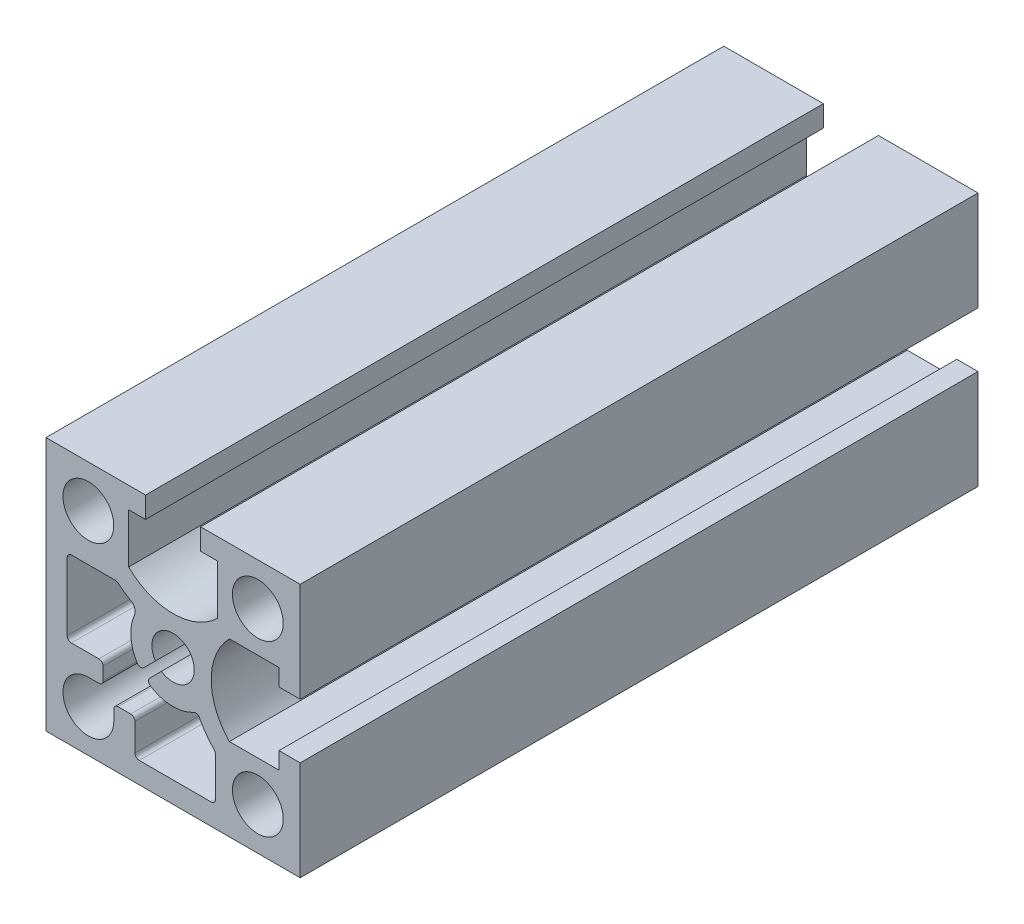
ISO-10303-21;
HEADER;
FILE_DESCRIPTION(('STEP AP214'),'2;1');
FILE_NAME('part.step','',(''),(''),'','','');
FILE_SCHEMA(('AUTOMOTIVE_DESIGN { 1 0 10303 214 1 1 1 1 }'));
ENDSEC;
DATA;
#1=APPLICATION_CONTEXT('core data for automotive mechanical design processes');
#2=APPLICATION_PROTOCOL_DEFINITION('international standard','automotive_design',2000,#1);
#3=PRODUCT_CONTEXT('',#1,'mechanical');
#4=PRODUCT('Part','Part','',(#3));
#5=PRODUCT_RELATED_PRODUCT_CATEGORY('part','',(#4));
#6=PRODUCT_DEFINITION_FORMATION('','',#4);
#7=PRODUCT_DEFINITION_CONTEXT('part definition',#1,'design');
#8=PRODUCT_DEFINITION('design','',#6,#7);
#9=PRODUCT_DEFINITION_SHAPE('','',#8);
#10=(LENGTH_UNIT() NAMED_UNIT(*) SI_UNIT(.MILLI.,.METRE.));
#11=(NAMED_UNIT(*) PLANE_ANGLE_UNIT() SI_UNIT($,.RADIAN.));
#12=(NAMED_UNIT(*) SI_UNIT($,.STERADIAN.) SOLID_ANGLE_UNIT());
#13=UNCERTAINTY_MEASURE_WITH_UNIT(LENGTH_MEASURE(1.E-05),#10,'distance_accuracy_value','');
#14=(GEOMETRIC_REPRESENTATION_CONTEXT(3) GLOBAL_UNCERTAINTY_ASSIGNED_CONTEXT((#13)) GLOBAL_UNIT_ASSIGNED_CONTEXT((#10,
#11,#12)) REPRESENTATION_CONTEXT('',''));
#15=CARTESIAN_POINT('',(0.,0.,0.));
#16=DIRECTION('',(0.,0.,1.));
#17=DIRECTION('',(1.,0.,0.));
#18=AXIS2_PLACEMENT_3D('',#15,#16,#17);
#19=CARTESIAN_POINT('',(12.,0.,40.));
#20=DIRECTION('',(0.,0.,-1.));
#21=DIRECTION('',(-1.,0.,0.));
#22=AXIS2_PLACEMENT_3D('',#19,#20,#21);
#23=PLANE('',#22);
#24=CARTESIAN_POINT('',(10.,-10.,40.));
#25=DIRECTION('',(0.,0.,1.));
#26=DIRECTION('',(-1.,0.,0.));
#27=AXIS2_PLACEMENT_3D('',#24,#25,#26);
#28=CIRCLE('',#27,3.);
#29=CARTESIAN_POINT('',(7.,-10.,40.));
#30=VERTEX_POINT('',#29);
#31=EDGE_CURVE('E1372',#30,#30,#28,.T.);
#32=ORIENTED_EDGE('',*,*,#31,.F.);
#33=EDGE_LOOP('',(#32));
#34=FACE_BOUND('',#33,.T.);
#35=CARTESIAN_POINT('',(0.,0.,40.));
#36=DIRECTION('',(0.,0.,1.));
#37=DIRECTION('',(1.,0.,0.));
#38=AXIS2_PLACEMENT_3D('',#35,#36,#37);
#39=CIRCLE('',#38,2.5);
#40=CARTESIAN_POINT('',(-1.3784974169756,-2.08560419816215,40.));
#41=VERTEX_POINT('',#40);
#42=CARTESIAN_POINT('',(-2.08560419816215,-1.3784974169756,40.));
#43=VERTEX_POINT('',#42);
#44=EDGE_CURVE('E366',#41,#43,#39,.T.);
#45=ORIENTED_EDGE('',*,*,#44,.F.);
#46=DIRECTION('',(0.707106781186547,0.707106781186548,0.));
#47=VECTOR('',#46,1.);
#48=CARTESIAN_POINT('',(-1.3784974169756,-2.08560419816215,40.));
#49=LINE('',#48,#47);
#50=CARTESIAN_POINT('',(-2.74886502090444,-3.45597180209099,40.));
#51=VERTEX_POINT('',#50);
#52=EDGE_CURVE('E449',#51,#41,#49,.T.);
#53=ORIENTED_EDGE('',*,*,#52,.F.);
#54=CARTESIAN_POINT('',(-2.39531163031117,-3.80952519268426,40.));
#55=DIRECTION('',(0.,0.,-1.));
#56=DIRECTION('',(-1.,0.,0.));
#57=AXIS2_PLACEMENT_3D('',#54,#55,#56);
#58=CIRCLE('',#57,0.5);
#59=CARTESIAN_POINT('',(-2.66145736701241,-4.23280576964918,40.));
#60=VERTEX_POINT('',#59);
#61=EDGE_CURVE('E447',#60,#51,#58,.T.);
#62=ORIENTED_EDGE('',*,*,#61,.F.);
#63=CARTESIAN_POINT('',(0.,0.,40.));
#64=DIRECTION('',(0.,0.,-1.));
#65=DIRECTION('',(1.,0.,0.));
#66=AXIS2_PLACEMENT_3D('',#63,#64,#65);
#67=CIRCLE('',#66,5.);
#68=CARTESIAN_POINT('',(2.42424242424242,-4.37299081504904,40.));
#69=VERTEX_POINT('',#68);
#70=EDGE_CURVE('E445',#69,#60,#67,.T.);
#71=ORIENTED_EDGE('',*,*,#70,.F.);
#72=CARTESIAN_POINT('',(2.66666666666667,-4.81028989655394,40.));
#73=DIRECTION('',(0.,0.,1.));
#74=DIRECTION('',(-1.,0.,0.));
#75=AXIS2_PLACEMENT_3D('',#72,#73,#74);
#76=CIRCLE('',#75,0.5);
#77=CARTESIAN_POINT('',(3.11111111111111,-4.58122847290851,40.));
#78=VERTEX_POINT('',#77);
#79=EDGE_CURVE('E443',#78,#69,#76,.T.);
#80=ORIENTED_EDGE('',*,*,#79,.F.);
#81=CARTESIAN_POINT('',(12.,0.,40.));
#82=DIRECTION('',(0.,0.,-1.));
#83=DIRECTION('',(-1.,0.,0.));
#84=AXIS2_PLACEMENT_3D('',#81,#82,#83);
#85=CIRCLE('',#84,10.);
#86=CARTESIAN_POINT('',(4.85714285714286,-6.99854212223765,40.));
#87=VERTEX_POINT('',#86);
#88=EDGE_CURVE('E441',#87,#78,#85,.T.);
#89=ORIENTED_EDGE('',*,*,#88,.F.);
#90=CARTESIAN_POINT('',(4.5,-7.34846922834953,40.));
#91=DIRECTION('',(0.,0.,1.));
#92=DIRECTION('',(-1.,0.,0.));
#93=AXIS2_PLACEMENT_3D('',#90,#91,#92);
#94=CIRCLE('',#93,0.5);
#95=CARTESIAN_POINT('',(5.,-7.34846922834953,40.));
#96=VERTEX_POINT('',#95);
#97=EDGE_CURVE('E439',#96,#87,#94,.T.);
#98=ORIENTED_EDGE('',*,*,#97,.F.);
#99=DIRECTION('',(0.,1.,0.));
#100=VECTOR('',#99,1.);
#101=CARTESIAN_POINT('',(5.,-12.,40.));
#102=LINE('',#101,#100);
#103=CARTESIAN_POINT('',(5.,-12.,40.));
#104=VERTEX_POINT('',#103);
#105=EDGE_CURVE('E437',#104,#96,#102,.T.);
#106=ORIENTED_EDGE('',*,*,#105,.F.);
#107=CARTESIAN_POINT('',(4.5,-12.,40.));
#108=DIRECTION('',(0.,0.,1.));
#109=DIRECTION('',(-1.,0.,0.));
#110=AXIS2_PLACEMENT_3D('',#107,#108,#109);
#111=CIRCLE('',#110,0.5);
#112=CARTESIAN_POINT('',(4.5,-12.5,40.));
#113=VERTEX_POINT('',#112);
#114=EDGE_CURVE('E435',#113,#104,#111,.T.);
#115=ORIENTED_EDGE('',*,*,#114,.F.);
#116=DIRECTION('',(1.,0.,0.));
#117=VECTOR('',#116,1.);
#118=CARTESIAN_POINT('',(-4.,-12.5,40.));
#119=LINE('',#118,#117);
#120=CARTESIAN_POINT('',(-4.,-12.5,40.));
#121=VERTEX_POINT('',#120);
#122=EDGE_CURVE('E433',#121,#113,#119,.T.);
#123=ORIENTED_EDGE('',*,*,#122,.F.);
#124=CARTESIAN_POINT('',(-4.,-12.,40.));
#125=DIRECTION('',(0.,0.,1.));
#126=DIRECTION('',(1.,0.,0.));
#127=AXIS2_PLACEMENT_3D('',#124,#125,#126);
#128=CIRCLE('',#127,0.500000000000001);
#129=CARTESIAN_POINT('',(-4.5,-12.,40.));
#130=VERTEX_POINT('',#129);
#131=EDGE_CURVE('E431',#130,#121,#128,.T.);
#132=ORIENTED_EDGE('',*,*,#131,.F.);
#133=DIRECTION('',(0.,-1.,0.));
#134=VECTOR('',#133,1.);
#135=CARTESIAN_POINT('',(-4.50000000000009,-8.76190332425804,40.));
#136=LINE('',#135,#134);
#137=CARTESIAN_POINT('',(-4.50000000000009,-8.76190332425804,40.));
#138=VERTEX_POINT('',#137);
#139=EDGE_CURVE('E429',#138,#130,#136,.T.);
#140=ORIENTED_EDGE('',*,*,#139,.F.);
#141=CARTESIAN_POINT('',(-5.,-8.76190332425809,40.));
#142=DIRECTION('',(0.,0.,-1.));
#143=DIRECTION('',(-1.,0.,0.));
#144=AXIS2_PLACEMENT_3D('',#141,#142,#143);
#145=CIRCLE('',#144,0.499999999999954);
#146=CARTESIAN_POINT('',(-5.,-8.26190332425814,40.));
#147=VERTEX_POINT('',#146);
#148=EDGE_CURVE('E427',#147,#138,#145,.T.);
#149=ORIENTED_EDGE('',*,*,#148,.F.);
#150=DIRECTION('',(1.,0.,0.));
#151=VECTOR('',#150,1.);
#152=CARTESIAN_POINT('',(-6.5,-8.26190332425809,40.));
#153=LINE('',#152,#151);
#154=CARTESIAN_POINT('',(-6.5,-8.26190332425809,40.));
#155=VERTEX_POINT('',#154);
#156=EDGE_CURVE('E425',#155,#147,#153,.T.);
#157=ORIENTED_EDGE('',*,*,#156,.F.);
#158=CARTESIAN_POINT('',(-6.5,-8.76190332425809,40.));
#159=DIRECTION('',(0.,0.,-1.));
#160=DIRECTION('',(1.,0.,0.));
#161=AXIS2_PLACEMENT_3D('',#158,#159,#160);
#162=CIRCLE('',#161,0.5);
#163=CARTESIAN_POINT('',(-7.,-8.76190332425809,40.));
#164=VERTEX_POINT('',#163);
#165=EDGE_CURVE('E423',#164,#155,#162,.T.);
#166=ORIENTED_EDGE('',*,*,#165,.F.);
#167=DIRECTION('',(0.,1.,0.));
#168=VECTOR('',#167,1.);
#169=CARTESIAN_POINT('',(-7.,-10.,40.));
#170=LINE('',#169,#168);
#171=CARTESIAN_POINT('',(-7.,-10.,40.));
#172=VERTEX_POINT('',#171);
#173=EDGE_CURVE('E421',#172,#164,#170,.T.);
#174=ORIENTED_EDGE('',*,*,#173,.F.);
#175=CARTESIAN_POINT('',(-10.,-10.,40.));
#176=DIRECTION('',(0.,0.,1.));
#177=DIRECTION('',(1.,0.,0.));
#178=AXIS2_PLACEMENT_3D('',#175,#176,#177);
#179=CIRCLE('',#178,3.);
#180=CARTESIAN_POINT('',(-10.,-7.,40.));
#181=VERTEX_POINT('',#180);
#182=EDGE_CURVE('E419',#181,#172,#179,.T.);
#183=ORIENTED_EDGE('',*,*,#182,.F.);
#184=DIRECTION('',(-1.,0.,0.));
#185=VECTOR('',#184,1.);
#186=CARTESIAN_POINT('',(-10.,-7.,40.));
#187=LINE('',#186,#185);
#188=CARTESIAN_POINT('',(-8.76190332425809,-7.,40.));
#189=VERTEX_POINT('',#188);
#190=EDGE_CURVE('E417',#189,#181,#187,.T.);
#191=ORIENTED_EDGE('',*,*,#190,.F.);
#192=CARTESIAN_POINT('',(-8.76190332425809,-6.5,40.));
#193=DIRECTION('',(0.,0.,-1.));
#194=DIRECTION('',(1.,0.,0.));
#195=AXIS2_PLACEMENT_3D('',#192,#193,#194);
#196=CIRCLE('',#195,0.5);
#197=CARTESIAN_POINT('',(-8.26190332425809,-6.5,40.));
#198=VERTEX_POINT('',#197);
#199=EDGE_CURVE('E415',#198,#189,#196,.T.);
#200=ORIENTED_EDGE('',*,*,#199,.F.);
#201=DIRECTION('',(0.,-1.,0.));
#202=VECTOR('',#201,1.);
#203=CARTESIAN_POINT('',(-8.26190332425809,-6.5,40.));
#204=LINE('',#203,#202);
#205=CARTESIAN_POINT('',(-8.26190332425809,-5.00000000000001,40.));
#206=VERTEX_POINT('',#205);
#207=EDGE_CURVE('E413',#206,#198,#204,.T.);
#208=ORIENTED_EDGE('',*,*,#207,.F.);
#209=CARTESIAN_POINT('',(-8.76190332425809,-5.00000000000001,40.));
#210=DIRECTION('',(0.,0.,-1.));
#211=DIRECTION('',(1.,0.,0.));
#212=AXIS2_PLACEMENT_3D('',#209,#210,#211);
#213=CIRCLE('',#212,0.500000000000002);
#214=CARTESIAN_POINT('',(-8.76190332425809,-4.5,40.));
#215=VERTEX_POINT('',#214);
#216=EDGE_CURVE('E411',#215,#206,#213,.T.);
#217=ORIENTED_EDGE('',*,*,#216,.F.);
#218=DIRECTION('',(1.,0.,0.));
#219=VECTOR('',#218,1.);
#220=CARTESIAN_POINT('',(-8.76190332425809,-4.5,40.));
#221=LINE('',#220,#219);
#222=CARTESIAN_POINT('',(-12.,-4.5,40.));
#223=VERTEX_POINT('',#222);
#224=EDGE_CURVE('E409',#223,#215,#221,.T.);
#225=ORIENTED_EDGE('',*,*,#224,.F.);
#226=CARTESIAN_POINT('',(-12.,-4.,40.));
#227=DIRECTION('',(0.,0.,1.));
#228=DIRECTION('',(-1.,0.,0.));
#229=AXIS2_PLACEMENT_3D('',#226,#227,#228);
#230=CIRCLE('',#229,0.500000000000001);
#231=CARTESIAN_POINT('',(-12.5,-4.,40.));
#232=VERTEX_POINT('',#231);
#233=EDGE_CURVE('E407',#232,#223,#230,.T.);
#234=ORIENTED_EDGE('',*,*,#233,.F.);
#235=DIRECTION('',(0.,-1.,0.));
#236=VECTOR('',#235,1.);
#237=CARTESIAN_POINT('',(-12.5,4.,40.));
#238=LINE('',#237,#236);
#239=CARTESIAN_POINT('',(-12.5,4.,40.));
#240=VERTEX_POINT('',#239);
#241=EDGE_CURVE('E405',#240,#232,#238,.T.);
#242=ORIENTED_EDGE('',*,*,#241,.F.);
#243=CARTESIAN_POINT('',(-12.,4.,40.));
#244=DIRECTION('',(0.,0.,1.));
#245=DIRECTION('',(-1.,0.,0.));
#246=AXIS2_PLACEMENT_3D('',#243,#244,#245);
#247=CIRCLE('',#246,0.500000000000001);
#248=CARTESIAN_POINT('',(-12.,4.5,40.));
#249=VERTEX_POINT('',#248);
#250=EDGE_CURVE('E403',#249,#240,#247,.T.);
#251=ORIENTED_EDGE('',*,*,#250,.F.);
#252=DIRECTION('',(-1.,0.,0.));
#253=VECTOR('',#252,1.);
#254=CARTESIAN_POINT('',(-6.80073525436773,4.5,40.));
#255=LINE('',#254,#253);
#256=CARTESIAN_POINT('',(-6.80073525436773,4.5,40.));
#257=VERTEX_POINT('',#256);
#258=EDGE_CURVE('E401',#257,#249,#255,.T.);
#259=ORIENTED_EDGE('',*,*,#258,.F.);
#260=CARTESIAN_POINT('',(-6.80073525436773,4.,40.));
#261=DIRECTION('',(0.,0.,1.));
#262=DIRECTION('',(-1.,0.,0.));
#263=AXIS2_PLACEMENT_3D('',#260,#261,#262);
#264=CIRCLE('',#263,0.500000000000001);
#265=CARTESIAN_POINT('',(-6.47689071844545,4.38095238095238,40.));
#266=VERTEX_POINT('',#265);
#267=EDGE_CURVE('E399',#266,#257,#264,.T.);
#268=ORIENTED_EDGE('',*,*,#267,.F.);
#269=CARTESIAN_POINT('',(0.,12.,40.));
#270=DIRECTION('',(0.,0.,-1.));
#271=DIRECTION('',(1.,0.,0.));
#272=AXIS2_PLACEMENT_3D('',#269,#270,#271);
#273=CIRCLE('',#272,10.);
#274=CARTESIAN_POINT('',(-4.97569275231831,3.32575757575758,40.));
#275=VERTEX_POINT('',#274);
#276=EDGE_CURVE('E397',#275,#266,#273,.T.);
#277=ORIENTED_EDGE('',*,*,#276,.F.);
#278=CARTESIAN_POINT('',(-5.47326202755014,2.45833333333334,40.));
#279=DIRECTION('',(0.,0.,1.));
#280=DIRECTION('',(-1.,0.,0.));
#281=AXIS2_PLACEMENT_3D('',#278,#279,#280);
#282=CIRCLE('',#281,1.);
#283=CARTESIAN_POINT('',(-4.56105168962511,2.04861111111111,40.));
#284=VERTEX_POINT('',#283);
#285=EDGE_CURVE('E395',#284,#275,#282,.T.);
#286=ORIENTED_EDGE('',*,*,#285,.F.);
#287=CARTESIAN_POINT('',(0.,0.,40.));
#288=DIRECTION('',(0.,0.,-1.));
#289=DIRECTION('',(1.,0.,0.));
#290=AXIS2_PLACEMENT_3D('',#287,#288,#289);
#291=CIRCLE('',#290,5.);
#292=CARTESIAN_POINT('',(-4.23280576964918,-2.66145736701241,40.));
#293=VERTEX_POINT('',#292);
#294=EDGE_CURVE('E390',#293,#284,#291,.T.);
#295=ORIENTED_EDGE('',*,*,#294,.F.);
#296=CARTESIAN_POINT('',(-3.80952519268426,-2.39531163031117,40.));
#297=DIRECTION('',(0.,0.,-1.));
#298=DIRECTION('',(-1.,0.,0.));
#299=AXIS2_PLACEMENT_3D('',#296,#297,#298);
#300=CIRCLE('',#299,0.5);
#301=CARTESIAN_POINT('',(-3.45597180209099,-2.74886502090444,40.));
#302=VERTEX_POINT('',#301);
#303=EDGE_CURVE('E388',#302,#293,#300,.T.);
#304=ORIENTED_EDGE('',*,*,#303,.F.);
#305=DIRECTION('',(-0.707106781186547,-0.707106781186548,0.));
#306=VECTOR('',#305,1.);
#307=CARTESIAN_POINT('',(-2.08560419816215,-1.3784974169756,40.));
#308=LINE('',#307,#306);
#309=EDGE_CURVE('E374',#43,#302,#308,.T.);
#310=ORIENTED_EDGE('',*,*,#309,.F.);
#311=EDGE_LOOP('',(#45,#53,#62,#71,#80,#89,#98,#106,#115,#123,#132,#140,#149,#157,#166,#174,
#183,#191,#200,#208,#217,#225,#234,#242,#251,#259,#268,#277,#286,#295,#304,#310));
#312=FACE_BOUND('',#311,.T.);
#313=DIRECTION('',(0.,-1.,0.));
#314=VECTOR('',#313,1.);
#315=CARTESIAN_POINT('',(-15.,15.,40.));
#316=LINE('',#315,#314);
#317=CARTESIAN_POINT('',(-15.,15.,40.));
#318=VERTEX_POINT('',#317);
#319=CARTESIAN_POINT('',(-15.,-14.9999999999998,40.));
#320=VERTEX_POINT('',#319);
#321=EDGE_CURVE('E602',#318,#320,#316,.T.);
#322=ORIENTED_EDGE('',*,*,#321,.T.);
#323=DIRECTION('',(1.,0.,0.));
#324=VECTOR('',#323,1.);
#325=CARTESIAN_POINT('',(-15.,-14.9999999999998,40.));
#326=LINE('',#325,#324);
#327=CARTESIAN_POINT('',(15.,-14.9999999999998,40.));
#328=VERTEX_POINT('',#327);
#329=EDGE_CURVE('E605',#320,#328,#326,.T.);
#330=ORIENTED_EDGE('',*,*,#329,.T.);
#331=DIRECTION('',(0.,1.,0.));
#332=VECTOR('',#331,1.);
#333=CARTESIAN_POINT('',(15.,-14.9999999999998,40.));
#334=LINE('',#333,#332);
#335=CARTESIAN_POINT('',(15.,-3.25,40.));
#336=VERTEX_POINT('',#335);
#337=EDGE_CURVE('E608',#328,#336,#334,.T.);
#338=ORIENTED_EDGE('',*,*,#337,.T.);
#339=DIRECTION('',(-1.,0.,0.));
#340=VECTOR('',#339,1.);
#341=CARTESIAN_POINT('',(15.,-3.25,40.));
#342=LINE('',#341,#340);
#343=CARTESIAN_POINT('',(12.5,-3.25,40.));
#344=VERTEX_POINT('',#343);
#345=EDGE_CURVE('E610',#336,#344,#342,.T.);
#346=ORIENTED_EDGE('',*,*,#345,.T.);
#347=DIRECTION('',(0.,-1.,0.));
#348=VECTOR('',#347,1.);
#349=CARTESIAN_POINT('',(12.5,-3.25,40.));
#350=LINE('',#349,#348);
#351=CARTESIAN_POINT('',(12.5,-5.25,40.));
#352=VERTEX_POINT('',#351);
#353=EDGE_CURVE('E612',#344,#352,#350,.T.);
#354=ORIENTED_EDGE('',*,*,#353,.T.);
#355=DIRECTION('',(-1.,0.,0.));
#356=VECTOR('',#355,1.);
#357=CARTESIAN_POINT('',(12.5,-5.25,40.));
#358=LINE('',#357,#356);
#359=CARTESIAN_POINT('',(6.64392867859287,-5.25,40.));
#360=VERTEX_POINT('',#359);
#361=EDGE_CURVE('E614',#352,#360,#358,.T.);
#362=ORIENTED_EDGE('',*,*,#361,.T.);
#363=CARTESIAN_POINT('',(12.,0.,40.));
#364=DIRECTION('',(0.,0.,-1.));
#365=DIRECTION('',(-1.,0.,0.));
#366=AXIS2_PLACEMENT_3D('',#363,#364,#365);
#367=CIRCLE('',#366,7.5);
#368=CARTESIAN_POINT('',(6.64392867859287,5.25,40.));
#369=VERTEX_POINT('',#368);
#370=EDGE_CURVE('E616',#360,#369,#367,.T.);
#371=ORIENTED_EDGE('',*,*,#370,.T.);
#372=DIRECTION('',(1.,0.,0.));
#373=VECTOR('',#372,1.);
#374=CARTESIAN_POINT('',(12.5,5.25,40.));
#375=LINE('',#374,#373);
#376=CARTESIAN_POINT('',(12.5,5.25,40.));
#377=VERTEX_POINT('',#376);
#378=EDGE_CURVE('E618',#369,#377,#375,.T.);
#379=ORIENTED_EDGE('',*,*,#378,.T.);
#380=DIRECTION('',(0.,-1.,0.));
#381=VECTOR('',#380,1.);
#382=CARTESIAN_POINT('',(12.5,3.25,40.));
#383=LINE('',#382,#381);
#384=CARTESIAN_POINT('',(12.5,3.25,40.));
#385=VERTEX_POINT('',#384);
#386=EDGE_CURVE('E620',#377,#385,#383,.T.);
#387=ORIENTED_EDGE('',*,*,#386,.T.);
#388=DIRECTION('',(1.,0.,0.));
#389=VECTOR('',#388,1.);
#390=CARTESIAN_POINT('',(15.,3.25,40.));
#391=LINE('',#390,#389);
#392=CARTESIAN_POINT('',(15.,3.25,40.));
#393=VERTEX_POINT('',#392);
#394=EDGE_CURVE('E622',#385,#393,#391,.T.);
#395=ORIENTED_EDGE('',*,*,#394,.T.);
#396=DIRECTION('',(0.,1.,0.));
#397=VECTOR('',#396,1.);
#398=CARTESIAN_POINT('',(15.,15.,40.));
#399=LINE('',#398,#397);
#400=CARTESIAN_POINT('',(15.,15.,40.));
#401=VERTEX_POINT('',#400);
#402=EDGE_CURVE('E624',#393,#401,#399,.T.);
#403=ORIENTED_EDGE('',*,*,#402,.T.);
#404=DIRECTION('',(-1.,0.,0.));
#405=VECTOR('',#404,1.);
#406=CARTESIAN_POINT('',(3.25000000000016,15.,40.));
#407=LINE('',#406,#405);
#408=CARTESIAN_POINT('',(3.25000000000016,15.,40.));
#409=VERTEX_POINT('',#408);
#410=EDGE_CURVE('E626',#401,#409,#407,.T.);
#411=ORIENTED_EDGE('',*,*,#410,.T.);
#412=DIRECTION('',(0.,-1.,0.));
#413=VECTOR('',#412,1.);
#414=CARTESIAN_POINT('',(3.25000000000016,15.,40.));
#415=LINE('',#414,#413);
#416=CARTESIAN_POINT('',(3.25000000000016,12.5,40.));
#417=VERTEX_POINT('',#416);
#418=EDGE_CURVE('E628',#409,#417,#415,.T.);
#419=ORIENTED_EDGE('',*,*,#418,.T.);
#420=DIRECTION('',(1.,0.,0.));
#421=VECTOR('',#420,1.);
#422=CARTESIAN_POINT('',(3.25000000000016,12.5,40.));
#423=LINE('',#422,#421);
#424=CARTESIAN_POINT('',(5.25,12.5,40.));
#425=VERTEX_POINT('',#424);
#426=EDGE_CURVE('E630',#417,#425,#423,.T.);
#427=ORIENTED_EDGE('',*,*,#426,.T.);
#428=DIRECTION('',(0.,-1.,0.));
#429=VECTOR('',#428,1.);
#430=CARTESIAN_POINT('',(5.25,12.5,40.));
#431=LINE('',#430,#429);
#432=CARTESIAN_POINT('',(5.25,6.64392867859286,40.));
#433=VERTEX_POINT('',#432);
#434=EDGE_CURVE('E632',#425,#433,#431,.T.);
#435=ORIENTED_EDGE('',*,*,#434,.T.);
#436=CARTESIAN_POINT('',(0.,12.,40.));
#437=DIRECTION('',(0.,0.,-1.));
#438=DIRECTION('',(1.,0.,0.));
#439=AXIS2_PLACEMENT_3D('',#436,#437,#438);
#440=CIRCLE('',#439,7.5);
#441=CARTESIAN_POINT('',(-5.25,6.64392867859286,40.));
#442=VERTEX_POINT('',#441);
#443=EDGE_CURVE('E634',#433,#442,#440,.T.);
#444=ORIENTED_EDGE('',*,*,#443,.T.);
#445=DIRECTION('',(0.,1.,0.));
#446=VECTOR('',#445,1.);
#447=CARTESIAN_POINT('',(-5.25,12.5,40.));
#448=LINE('',#447,#446);
#449=CARTESIAN_POINT('',(-5.25,12.5,40.));
#450=VERTEX_POINT('',#449);
#451=EDGE_CURVE('E636',#442,#450,#448,.T.);
#452=ORIENTED_EDGE('',*,*,#451,.T.);
#453=DIRECTION('',(1.,0.,0.));
#454=VECTOR('',#453,1.);
#455=CARTESIAN_POINT('',(-3.25000000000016,12.5,40.));
#456=LINE('',#455,#454);
#457=CARTESIAN_POINT('',(-3.25000000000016,12.5,40.));
#458=VERTEX_POINT('',#457);
#459=EDGE_CURVE('E638',#450,#458,#456,.T.);
#460=ORIENTED_EDGE('',*,*,#459,.T.);
#461=DIRECTION('',(0.,1.,0.));
#462=VECTOR('',#461,1.);
#463=CARTESIAN_POINT('',(-3.25000000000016,15.,40.));
#464=LINE('',#463,#462);
#465=CARTESIAN_POINT('',(-3.25000000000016,15.,40.));
#466=VERTEX_POINT('',#465);
#467=EDGE_CURVE('E640',#458,#466,#464,.T.);
#468=ORIENTED_EDGE('',*,*,#467,.T.);
#469=DIRECTION('',(-1.,0.,0.));
#470=VECTOR('',#469,1.);
#471=CARTESIAN_POINT('',(-15.,15.,40.));
#472=LINE('',#471,#470);
#473=EDGE_CURVE('E642',#466,#318,#472,.T.);
#474=ORIENTED_EDGE('',*,*,#473,.T.);
#475=EDGE_LOOP('',(#322,#330,#338,#346,#354,#362,#371,#379,#387,#395,#403,#411,#419,#427,#435,
#444,#452,#460,#468,#474));
#476=FACE_BOUND('',#475,.T.);
#477=CARTESIAN_POINT('',(10.,10.,40.));
#478=DIRECTION('',(0.,0.,1.));
#479=DIRECTION('',(1.,0.,0.));
#480=AXIS2_PLACEMENT_3D('',#477,#478,#479);
#481=CIRCLE('',#480,3.);
#482=CARTESIAN_POINT('',(13.,10.,40.));
#483=VERTEX_POINT('',#482);
#484=EDGE_CURVE('E452',#483,#483,#481,.T.);
#485=ORIENTED_EDGE('',*,*,#484,.F.);
#486=EDGE_LOOP('',(#485));
#487=FACE_BOUND('',#486,.T.);
#488=CARTESIAN_POINT('',(-10.,10.,40.));
#489=DIRECTION('',(0.,0.,1.));
#490=DIRECTION('',(-1.,0.,0.));
#491=AXIS2_PLACEMENT_3D('',#488,#489,#490);
#492=CIRCLE('',#491,3.);
#493=CARTESIAN_POINT('',(-13.,10.,40.));
#494=VERTEX_POINT('',#493);
#495=EDGE_CURVE('E1363',#494,#494,#492,.T.);
#496=ORIENTED_EDGE('',*,*,#495,.F.);
#497=EDGE_LOOP('',(#496));
#498=FACE_BOUND('',#497,.T.);
#499=ADVANCED_FACE('F37',(#34,#312,#476,#487,#498),#23,.F.);
#500=CARTESIAN_POINT('',(12.,0.,-40.));
#501=DIRECTION('',(0.,0.,-1.));
#502=DIRECTION('',(-1.,0.,0.));
#503=AXIS2_PLACEMENT_3D('',#500,#501,#502);
#504=PLANE('',#503);
#505=CARTESIAN_POINT('',(10.,-10.,-40.));
#506=DIRECTION('',(0.,0.,1.));
#507=DIRECTION('',(-1.,0.,0.));
#508=AXIS2_PLACEMENT_3D('',#505,#506,#507);
#509=CIRCLE('',#508,3.);
#510=CARTESIAN_POINT('',(7.,-10.,-40.));
#511=VERTEX_POINT('',#510);
#512=EDGE_CURVE('E1369',#511,#511,#509,.T.);
#513=ORIENTED_EDGE('',*,*,#512,.T.);
#514=EDGE_LOOP('',(#513));
#515=FACE_BOUND('',#514,.T.);
#516=DIRECTION('',(0.707106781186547,0.707106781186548,0.));
#517=VECTOR('',#516,1.);
#518=CARTESIAN_POINT('',(-1.3784974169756,-2.08560419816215,-40.));
#519=LINE('',#518,#517);
#520=CARTESIAN_POINT('',(-2.74886502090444,-3.45597180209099,-40.));
#521=VERTEX_POINT('',#520);
#522=CARTESIAN_POINT('',(-1.3784974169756,-2.08560419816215,-40.));
#523=VERTEX_POINT('',#522);
#524=EDGE_CURVE('E375',#521,#523,#519,.T.);
#525=ORIENTED_EDGE('',*,*,#524,.T.);
#526=CARTESIAN_POINT('',(0.,0.,-40.));
#527=DIRECTION('',(0.,0.,1.));
#528=DIRECTION('',(1.,0.,0.));
#529=AXIS2_PLACEMENT_3D('',#526,#527,#528);
#530=CIRCLE('',#529,2.5);
#531=CARTESIAN_POINT('',(-2.08560419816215,-1.3784974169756,-40.));
#532=VERTEX_POINT('',#531);
#533=EDGE_CURVE('E60',#523,#532,#530,.T.);
#534=ORIENTED_EDGE('',*,*,#533,.T.);
#535=DIRECTION('',(-0.707106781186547,-0.707106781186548,0.));
#536=VECTOR('',#535,1.);
#537=CARTESIAN_POINT('',(-2.08560419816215,-1.3784974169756,-40.));
#538=LINE('',#537,#536);
#539=CARTESIAN_POINT('',(-3.45597180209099,-2.74886502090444,-40.));
#540=VERTEX_POINT('',#539);
#541=EDGE_CURVE('E381',#532,#540,#538,.T.);
#542=ORIENTED_EDGE('',*,*,#541,.T.);
#543=CARTESIAN_POINT('',(-3.80952519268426,-2.39531163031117,-40.));
#544=DIRECTION('',(0.,0.,-1.));
#545=DIRECTION('',(-1.,0.,0.));
#546=AXIS2_PLACEMENT_3D('',#543,#544,#545);
#547=CIRCLE('',#546,0.5);
#548=CARTESIAN_POINT('',(-4.23280576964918,-2.66145736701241,-40.));
#549=VERTEX_POINT('',#548);
#550=EDGE_CURVE('E454',#540,#549,#547,.T.);
#551=ORIENTED_EDGE('',*,*,#550,.T.);
#552=CARTESIAN_POINT('',(0.,0.,-40.));
#553=DIRECTION('',(0.,0.,-1.));
#554=DIRECTION('',(1.,0.,0.));
#555=AXIS2_PLACEMENT_3D('',#552,#553,#554);
#556=CIRCLE('',#555,5.);
#557=CARTESIAN_POINT('',(-4.56105168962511,2.04861111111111,-40.));
#558=VERTEX_POINT('',#557);
#559=EDGE_CURVE('E457',#549,#558,#556,.T.);
#560=ORIENTED_EDGE('',*,*,#559,.T.);
#561=CARTESIAN_POINT('',(-5.47326202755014,2.45833333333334,-40.));
#562=DIRECTION('',(0.,0.,1.));
#563=DIRECTION('',(-1.,0.,0.));
#564=AXIS2_PLACEMENT_3D('',#561,#562,#563);
#565=CIRCLE('',#564,1.);
#566=CARTESIAN_POINT('',(-4.97569275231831,3.32575757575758,-40.));
#567=VERTEX_POINT('',#566);
#568=EDGE_CURVE('E460',#558,#567,#565,.T.);
#569=ORIENTED_EDGE('',*,*,#568,.T.);
#570=CARTESIAN_POINT('',(0.,12.,-40.));
#571=DIRECTION('',(0.,0.,-1.));
#572=DIRECTION('',(1.,0.,0.));
#573=AXIS2_PLACEMENT_3D('',#570,#571,#572);
#574=CIRCLE('',#573,10.);
#575=CARTESIAN_POINT('',(-6.47689071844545,4.38095238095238,-40.));
#576=VERTEX_POINT('',#575);
#577=EDGE_CURVE('E463',#567,#576,#574,.T.);
#578=ORIENTED_EDGE('',*,*,#577,.T.);
#579=CARTESIAN_POINT('',(-6.80073525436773,4.,-40.));
#580=DIRECTION('',(0.,0.,1.));
#581=DIRECTION('',(-1.,0.,0.));
#582=AXIS2_PLACEMENT_3D('',#579,#580,#581);
#583=CIRCLE('',#582,0.500000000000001);
#584=CARTESIAN_POINT('',(-6.80073525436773,4.5,-40.));
#585=VERTEX_POINT('',#584);
#586=EDGE_CURVE('E466',#576,#585,#583,.T.);
#587=ORIENTED_EDGE('',*,*,#586,.T.);
#588=DIRECTION('',(-1.,0.,0.));
#589=VECTOR('',#588,1.);
#590=CARTESIAN_POINT('',(-6.80073525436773,4.5,-40.));
#591=LINE('',#590,#589);
#592=CARTESIAN_POINT('',(-12.,4.5,-40.));
#593=VERTEX_POINT('',#592);
#594=EDGE_CURVE('E469',#585,#593,#591,.T.);
#595=ORIENTED_EDGE('',*,*,#594,.T.);
#596=CARTESIAN_POINT('',(-12.,4.,-40.));
#597=DIRECTION('',(0.,0.,1.));
#598=DIRECTION('',(-1.,0.,0.));
#599=AXIS2_PLACEMENT_3D('',#596,#597,#598);
#600=CIRCLE('',#599,0.500000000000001);
#601=CARTESIAN_POINT('',(-12.5,4.,-40.));
#602=VERTEX_POINT('',#601);
#603=EDGE_CURVE('E472',#593,#602,#600,.T.);
#604=ORIENTED_EDGE('',*,*,#603,.T.);
#605=DIRECTION('',(0.,-1.,0.));
#606=VECTOR('',#605,1.);
#607=CARTESIAN_POINT('',(-12.5,4.,-40.));
#608=LINE('',#607,#606);
#609=CARTESIAN_POINT('',(-12.5,-4.,-40.));
#610=VERTEX_POINT('',#609);
#611=EDGE_CURVE('E475',#602,#610,#608,.T.);
#612=ORIENTED_EDGE('',*,*,#611,.T.);
#613=CARTESIAN_POINT('',(-12.,-4.,-40.));
#614=DIRECTION('',(0.,0.,1.));
#615=DIRECTION('',(-1.,0.,0.));
#616=AXIS2_PLACEMENT_3D('',#613,#614,#615);
#617=CIRCLE('',#616,0.500000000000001);
#618=CARTESIAN_POINT('',(-12.,-4.5,-40.));
#619=VERTEX_POINT('',#618);
#620=EDGE_CURVE('E478',#610,#619,#617,.T.);
#621=ORIENTED_EDGE('',*,*,#620,.T.);
#622=DIRECTION('',(1.,0.,0.));
#623=VECTOR('',#622,1.);
#624=CARTESIAN_POINT('',(-8.76190332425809,-4.5,-40.));
#625=LINE('',#624,#623);
#626=CARTESIAN_POINT('',(-8.76190332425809,-4.5,-40.));
#627=VERTEX_POINT('',#626);
#628=EDGE_CURVE('E481',#619,#627,#625,.T.);
#629=ORIENTED_EDGE('',*,*,#628,.T.);
#630=CARTESIAN_POINT('',(-8.76190332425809,-5.00000000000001,-40.));
#631=DIRECTION('',(0.,0.,-1.));
#632=DIRECTION('',(1.,0.,0.));
#633=AXIS2_PLACEMENT_3D('',#630,#631,#632);
#634=CIRCLE('',#633,0.500000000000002);
#635=CARTESIAN_POINT('',(-8.26190332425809,-5.00000000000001,-40.));
#636=VERTEX_POINT('',#635);
#637=EDGE_CURVE('E484',#627,#636,#634,.T.);
#638=ORIENTED_EDGE('',*,*,#637,.T.);
#639=DIRECTION('',(0.,-1.,0.));
#640=VECTOR('',#639,1.);
#641=CARTESIAN_POINT('',(-8.26190332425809,-6.5,-40.));
#642=LINE('',#641,#640);
#643=CARTESIAN_POINT('',(-8.26190332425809,-6.5,-40.));
#644=VERTEX_POINT('',#643);
#645=EDGE_CURVE('E487',#636,#644,#642,.T.);
#646=ORIENTED_EDGE('',*,*,#645,.T.);
#647=CARTESIAN_POINT('',(-8.76190332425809,-6.5,-40.));
#648=DIRECTION('',(0.,0.,-1.));
#649=DIRECTION('',(1.,0.,0.));
#650=AXIS2_PLACEMENT_3D('',#647,#648,#649);
#651=CIRCLE('',#650,0.5);
#652=CARTESIAN_POINT('',(-8.76190332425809,-7.,-40.));
#653=VERTEX_POINT('',#652);
#654=EDGE_CURVE('E490',#644,#653,#651,.T.);
#655=ORIENTED_EDGE('',*,*,#654,.T.);
#656=DIRECTION('',(-1.,0.,0.));
#657=VECTOR('',#656,1.);
#658=CARTESIAN_POINT('',(-10.,-7.,-40.));
#659=LINE('',#658,#657);
#660=CARTESIAN_POINT('',(-10.,-7.,-40.));
#661=VERTEX_POINT('',#660);
#662=EDGE_CURVE('E493',#653,#661,#659,.T.);
#663=ORIENTED_EDGE('',*,*,#662,.T.);
#664=CARTESIAN_POINT('',(-10.,-10.,-40.));
#665=DIRECTION('',(0.,0.,1.));
#666=DIRECTION('',(1.,0.,0.));
#667=AXIS2_PLACEMENT_3D('',#664,#665,#666);
#668=CIRCLE('',#667,3.);
#669=CARTESIAN_POINT('',(-7.,-10.,-40.));
#670=VERTEX_POINT('',#669);
#671=EDGE_CURVE('E496',#661,#670,#668,.T.);
#672=ORIENTED_EDGE('',*,*,#671,.T.);
#673=DIRECTION('',(0.,1.,0.));
#674=VECTOR('',#673,1.);
#675=CARTESIAN_POINT('',(-7.,-10.,-40.));
#676=LINE('',#675,#674);
#677=CARTESIAN_POINT('',(-7.,-8.76190332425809,-40.));
#678=VERTEX_POINT('',#677);
#679=EDGE_CURVE('E499',#670,#678,#676,.T.);
#680=ORIENTED_EDGE('',*,*,#679,.T.);
#681=CARTESIAN_POINT('',(-6.5,-8.76190332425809,-40.));
#682=DIRECTION('',(0.,0.,-1.));
#683=DIRECTION('',(1.,0.,0.));
#684=AXIS2_PLACEMENT_3D('',#681,#682,#683);
#685=CIRCLE('',#684,0.5);
#686=CARTESIAN_POINT('',(-6.5,-8.26190332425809,-40.));
#687=VERTEX_POINT('',#686);
#688=EDGE_CURVE('E502',#678,#687,#685,.T.);
#689=ORIENTED_EDGE('',*,*,#688,.T.);
#690=DIRECTION('',(1.,0.,0.));
#691=VECTOR('',#690,1.);
#692=CARTESIAN_POINT('',(-6.5,-8.26190332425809,-40.));
#693=LINE('',#692,#691);
#694=CARTESIAN_POINT('',(-5.,-8.26190332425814,-40.));
#695=VERTEX_POINT('',#694);
#696=EDGE_CURVE('E505',#687,#695,#693,.T.);
#697=ORIENTED_EDGE('',*,*,#696,.T.);
#698=CARTESIAN_POINT('',(-5.,-8.76190332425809,-40.));
#699=DIRECTION('',(0.,0.,-1.));
#700=DIRECTION('',(-1.,0.,0.));
#701=AXIS2_PLACEMENT_3D('',#698,#699,#700);
#702=CIRCLE('',#701,0.499999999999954);
#703=CARTESIAN_POINT('',(-4.50000000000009,-8.76190332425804,-40.));
#704=VERTEX_POINT('',#703);
#705=EDGE_CURVE('E508',#695,#704,#702,.T.);
#706=ORIENTED_EDGE('',*,*,#705,.T.);
#707=DIRECTION('',(0.,-1.,0.));
#708=VECTOR('',#707,1.);
#709=CARTESIAN_POINT('',(-4.50000000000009,-8.76190332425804,-40.));
#710=LINE('',#709,#708);
#711=CARTESIAN_POINT('',(-4.5,-12.,-40.));
#712=VERTEX_POINT('',#711);
#713=EDGE_CURVE('E511',#704,#712,#710,.T.);
#714=ORIENTED_EDGE('',*,*,#713,.T.);
#715=CARTESIAN_POINT('',(-4.,-12.,-40.));
#716=DIRECTION('',(0.,0.,1.));
#717=DIRECTION('',(1.,0.,0.));
#718=AXIS2_PLACEMENT_3D('',#715,#716,#717);
#719=CIRCLE('',#718,0.500000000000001);
#720=CARTESIAN_POINT('',(-4.,-12.5,-40.));
#721=VERTEX_POINT('',#720);
#722=EDGE_CURVE('E514',#712,#721,#719,.T.);
#723=ORIENTED_EDGE('',*,*,#722,.T.);
#724=DIRECTION('',(1.,0.,0.));
#725=VECTOR('',#724,1.);
#726=CARTESIAN_POINT('',(-4.,-12.5,-40.));
#727=LINE('',#726,#725);
#728=CARTESIAN_POINT('',(4.5,-12.5,-40.));
#729=VERTEX_POINT('',#728);
#730=EDGE_CURVE('E517',#721,#729,#727,.T.);
#731=ORIENTED_EDGE('',*,*,#730,.T.);
#732=CARTESIAN_POINT('',(4.5,-12.,-40.));
#733=DIRECTION('',(0.,0.,1.));
#734=DIRECTION('',(-1.,0.,0.));
#735=AXIS2_PLACEMENT_3D('',#732,#733,#734);
#736=CIRCLE('',#735,0.5);
#737=CARTESIAN_POINT('',(5.,-12.,-40.));
#738=VERTEX_POINT('',#737);
#739=EDGE_CURVE('E520',#729,#738,#736,.T.);
#740=ORIENTED_EDGE('',*,*,#739,.T.);
#741=DIRECTION('',(0.,1.,0.));
#742=VECTOR('',#741,1.);
#743=CARTESIAN_POINT('',(5.,-12.,-40.));
#744=LINE('',#743,#742);
#745=CARTESIAN_POINT('',(5.,-7.34846922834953,-40.));
#746=VERTEX_POINT('',#745);
#747=EDGE_CURVE('E523',#738,#746,#744,.T.);
#748=ORIENTED_EDGE('',*,*,#747,.T.);
#749=CARTESIAN_POINT('',(4.5,-7.34846922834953,-40.));
#750=DIRECTION('',(0.,0.,1.));
#751=DIRECTION('',(-1.,0.,0.));
#752=AXIS2_PLACEMENT_3D('',#749,#750,#751);
#753=CIRCLE('',#752,0.5);
#754=CARTESIAN_POINT('',(4.85714285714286,-6.99854212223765,-40.));
#755=VERTEX_POINT('',#754);
#756=EDGE_CURVE('E526',#746,#755,#753,.T.);
#757=ORIENTED_EDGE('',*,*,#756,.T.);
#758=CARTESIAN_POINT('',(12.,0.,-40.));
#759=DIRECTION('',(0.,0.,-1.));
#760=DIRECTION('',(-1.,0.,0.));
#761=AXIS2_PLACEMENT_3D('',#758,#759,#760);
#762=CIRCLE('',#761,10.);
#763=CARTESIAN_POINT('',(3.11111111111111,-4.58122847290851,-40.));
#764=VERTEX_POINT('',#763);
#765=EDGE_CURVE('E529',#755,#764,#762,.T.);
#766=ORIENTED_EDGE('',*,*,#765,.T.);
#767=CARTESIAN_POINT('',(2.66666666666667,-4.81028989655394,-40.));
#768=DIRECTION('',(0.,0.,1.));
#769=DIRECTION('',(-1.,0.,0.));
#770=AXIS2_PLACEMENT_3D('',#767,#768,#769);
#771=CIRCLE('',#770,0.5);
#772=CARTESIAN_POINT('',(2.42424242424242,-4.37299081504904,-40.));
#773=VERTEX_POINT('',#772);
#774=EDGE_CURVE('E532',#764,#773,#771,.T.);
#775=ORIENTED_EDGE('',*,*,#774,.T.);
#776=CARTESIAN_POINT('',(0.,0.,-40.));
#777=DIRECTION('',(0.,0.,-1.));
#778=DIRECTION('',(1.,0.,0.));
#779=AXIS2_PLACEMENT_3D('',#776,#777,#778);
#780=CIRCLE('',#779,5.);
#781=CARTESIAN_POINT('',(-2.66145736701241,-4.23280576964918,-40.));
#782=VERTEX_POINT('',#781);
#783=EDGE_CURVE('E535',#773,#782,#780,.T.);
#784=ORIENTED_EDGE('',*,*,#783,.T.);
#785=CARTESIAN_POINT('',(-2.39531163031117,-3.80952519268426,-40.));
#786=DIRECTION('',(0.,0.,-1.));
#787=DIRECTION('',(-1.,0.,0.));
#788=AXIS2_PLACEMENT_3D('',#785,#786,#787);
#789=CIRCLE('',#788,0.5);
#790=EDGE_CURVE('E538',#782,#521,#789,.T.);
#791=ORIENTED_EDGE('',*,*,#790,.T.);
#792=EDGE_LOOP('',(#525,#534,#542,#551,#560,#569,#578,#587,#595,#604,#612,#621,#629,#638,#646,
#655,#663,#672,#680,#689,#697,#706,#714,#723,#731,#740,#748,#757,#766,#775,#784,#791));
#793=FACE_BOUND('',#792,.T.);
#794=DIRECTION('',(0.,-1.,0.));
#795=VECTOR('',#794,1.);
#796=CARTESIAN_POINT('',(-15.,15.,-40.));
#797=LINE('',#796,#795);
#798=CARTESIAN_POINT('',(-15.,15.,-40.));
#799=VERTEX_POINT('',#798);
#800=CARTESIAN_POINT('',(-15.,-14.9999999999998,-40.));
#801=VERTEX_POINT('',#800);
#802=EDGE_CURVE('E382',#799,#801,#797,.T.);
#803=ORIENTED_EDGE('',*,*,#802,.F.);
#804=DIRECTION('',(-1.,0.,0.));
#805=VECTOR('',#804,1.);
#806=CARTESIAN_POINT('',(-15.,15.,-40.));
#807=LINE('',#806,#805);
#808=CARTESIAN_POINT('',(-3.25000000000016,15.,-40.));
#809=VERTEX_POINT('',#808);
#810=EDGE_CURVE('E606',#809,#799,#807,.T.);
#811=ORIENTED_EDGE('',*,*,#810,.F.);
#812=DIRECTION('',(0.,1.,0.));
#813=VECTOR('',#812,1.);
#814=CARTESIAN_POINT('',(-3.25000000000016,15.,-40.));
#815=LINE('',#814,#813);
#816=CARTESIAN_POINT('',(-3.25000000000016,12.5,-40.));
#817=VERTEX_POINT('',#816);
#818=EDGE_CURVE('E681',#817,#809,#815,.T.);
#819=ORIENTED_EDGE('',*,*,#818,.F.);
#820=DIRECTION('',(1.,0.,0.));
#821=VECTOR('',#820,1.);
#822=CARTESIAN_POINT('',(-3.25000000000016,12.5,-40.));
#823=LINE('',#822,#821);
#824=CARTESIAN_POINT('',(-5.25,12.5,-40.));
#825=VERTEX_POINT('',#824);
#826=EDGE_CURVE('E679',#825,#817,#823,.T.);
#827=ORIENTED_EDGE('',*,*,#826,.F.);
#828=DIRECTION('',(0.,1.,0.));
#829=VECTOR('',#828,1.);
#830=CARTESIAN_POINT('',(-5.25,12.5,-40.));
#831=LINE('',#830,#829);
#832=CARTESIAN_POINT('',(-5.25,6.64392867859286,-40.));
#833=VERTEX_POINT('',#832);
#834=EDGE_CURVE('E677',#833,#825,#831,.T.);
#835=ORIENTED_EDGE('',*,*,#834,.F.);
#836=CARTESIAN_POINT('',(0.,12.,-40.));
#837=DIRECTION('',(0.,0.,-1.));
#838=DIRECTION('',(1.,0.,0.));
#839=AXIS2_PLACEMENT_3D('',#836,#837,#838);
#840=CIRCLE('',#839,7.5);
#841=CARTESIAN_POINT('',(5.25,6.64392867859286,-40.));
#842=VERTEX_POINT('',#841);
#843=EDGE_CURVE('E675',#842,#833,#840,.T.);
#844=ORIENTED_EDGE('',*,*,#843,.F.);
#845=DIRECTION('',(0.,-1.,0.));
#846=VECTOR('',#845,1.);
#847=CARTESIAN_POINT('',(5.25,12.5,-40.));
#848=LINE('',#847,#846);
#849=CARTESIAN_POINT('',(5.25,12.5,-40.));
#850=VERTEX_POINT('',#849);
#851=EDGE_CURVE('E673',#850,#842,#848,.T.);
#852=ORIENTED_EDGE('',*,*,#851,.F.);
#853=DIRECTION('',(1.,0.,0.));
#854=VECTOR('',#853,1.);
#855=CARTESIAN_POINT('',(3.25000000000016,12.5,-40.));
#856=LINE('',#855,#854);
#857=CARTESIAN_POINT('',(3.25000000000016,12.5,-40.));
#858=VERTEX_POINT('',#857);
#859=EDGE_CURVE('E671',#858,#850,#856,.T.);
#860=ORIENTED_EDGE('',*,*,#859,.F.);
#861=DIRECTION('',(0.,-1.,0.));
#862=VECTOR('',#861,1.);
#863=CARTESIAN_POINT('',(3.25000000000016,15.,-40.));
#864=LINE('',#863,#862);
#865=CARTESIAN_POINT('',(3.25000000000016,15.,-40.));
#866=VERTEX_POINT('',#865);
#867=EDGE_CURVE('E669',#866,#858,#864,.T.);
#868=ORIENTED_EDGE('',*,*,#867,.F.);
#869=DIRECTION('',(-1.,0.,0.));
#870=VECTOR('',#869,1.);
#871=CARTESIAN_POINT('',(3.25000000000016,15.,-40.));
#872=LINE('',#871,#870);
#873=CARTESIAN_POINT('',(15.,15.,-40.));
#874=VERTEX_POINT('',#873);
#875=EDGE_CURVE('E667',#874,#866,#872,.T.);
#876=ORIENTED_EDGE('',*,*,#875,.F.);
#877=DIRECTION('',(0.,1.,0.));
#878=VECTOR('',#877,1.);
#879=CARTESIAN_POINT('',(15.,15.,-40.));
#880=LINE('',#879,#878);
#881=CARTESIAN_POINT('',(15.,3.25,-40.));
#882=VERTEX_POINT('',#881);
#883=EDGE_CURVE('E665',#882,#874,#880,.T.);
#884=ORIENTED_EDGE('',*,*,#883,.F.);
#885=DIRECTION('',(1.,0.,0.));
#886=VECTOR('',#885,1.);
#887=CARTESIAN_POINT('',(15.,3.25,-40.));
#888=LINE('',#887,#886);
#889=CARTESIAN_POINT('',(12.5,3.25,-40.));
#890=VERTEX_POINT('',#889);
#891=EDGE_CURVE('E663',#890,#882,#888,.T.);
#892=ORIENTED_EDGE('',*,*,#891,.F.);
#893=DIRECTION('',(0.,-1.,0.));
#894=VECTOR('',#893,1.);
#895=CARTESIAN_POINT('',(12.5,3.25,-40.));
#896=LINE('',#895,#894);
#897=CARTESIAN_POINT('',(12.5,5.25,-40.));
#898=VERTEX_POINT('',#897);
#899=EDGE_CURVE('E661',#898,#890,#896,.T.);
#900=ORIENTED_EDGE('',*,*,#899,.F.);
#901=DIRECTION('',(1.,0.,0.));
#902=VECTOR('',#901,1.);
#903=CARTESIAN_POINT('',(12.5,5.25,-40.));
#904=LINE('',#903,#902);
#905=CARTESIAN_POINT('',(6.64392867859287,5.25,-40.));
#906=VERTEX_POINT('',#905);
#907=EDGE_CURVE('E659',#906,#898,#904,.T.);
#908=ORIENTED_EDGE('',*,*,#907,.F.);
#909=CARTESIAN_POINT('',(12.,0.,-40.));
#910=DIRECTION('',(0.,0.,-1.));
#911=DIRECTION('',(-1.,0.,0.));
#912=AXIS2_PLACEMENT_3D('',#909,#910,#911);
#913=CIRCLE('',#912,7.5);
#914=CARTESIAN_POINT('',(6.64392867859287,-5.25,-40.));
#915=VERTEX_POINT('',#914);
#916=EDGE_CURVE('E657',#915,#906,#913,.T.);
#917=ORIENTED_EDGE('',*,*,#916,.F.);
#918=DIRECTION('',(-1.,0.,0.));
#919=VECTOR('',#918,1.);
#920=CARTESIAN_POINT('',(12.5,-5.25,-40.));
#921=LINE('',#920,#919);
#922=CARTESIAN_POINT('',(12.5,-5.25,-40.));
#923=VERTEX_POINT('',#922);
#924=EDGE_CURVE('E655',#923,#915,#921,.T.);
#925=ORIENTED_EDGE('',*,*,#924,.F.);
#926=DIRECTION('',(0.,-1.,0.));
#927=VECTOR('',#926,1.);
#928=CARTESIAN_POINT('',(12.5,-3.25,-40.));
#929=LINE('',#928,#927);
#930=CARTESIAN_POINT('',(12.5,-3.25,-40.));
#931=VERTEX_POINT('',#930);
#932=EDGE_CURVE('E653',#931,#923,#929,.T.);
#933=ORIENTED_EDGE('',*,*,#932,.F.);
#934=DIRECTION('',(-1.,0.,0.));
#935=VECTOR('',#934,1.);
#936=CARTESIAN_POINT('',(15.,-3.25,-40.));
#937=LINE('',#936,#935);
#938=CARTESIAN_POINT('',(15.,-3.25,-40.));
#939=VERTEX_POINT('',#938);
#940=EDGE_CURVE('E651',#939,#931,#937,.T.);
#941=ORIENTED_EDGE('',*,*,#940,.F.);
#942=DIRECTION('',(0.,1.,0.));
#943=VECTOR('',#942,1.);
#944=CARTESIAN_POINT('',(15.,-14.9999999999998,-40.));
#945=LINE('',#944,#943);
#946=CARTESIAN_POINT('',(15.,-14.9999999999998,-40.));
#947=VERTEX_POINT('',#946);
#948=EDGE_CURVE('E649',#947,#939,#945,.T.);
#949=ORIENTED_EDGE('',*,*,#948,.F.);
#950=DIRECTION('',(1.,0.,0.));
#951=VECTOR('',#950,1.);
#952=CARTESIAN_POINT('',(-15.,-14.9999999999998,-40.));
#953=LINE('',#952,#951);
#954=EDGE_CURVE('E647',#801,#947,#953,.T.);
#955=ORIENTED_EDGE('',*,*,#954,.F.);
#956=EDGE_LOOP('',(#803,#811,#819,#827,#835,#844,#852,#860,#868,#876,#884,#892,#900,#908,#917,
#925,#933,#941,#949,#955));
#957=FACE_BOUND('',#956,.T.);
#958=CARTESIAN_POINT('',(10.,10.,-40.));
#959=DIRECTION('',(0.,0.,1.));
#960=DIRECTION('',(1.,0.,0.));
#961=AXIS2_PLACEMENT_3D('',#958,#959,#960);
#962=CIRCLE('',#961,3.);
#963=CARTESIAN_POINT('',(13.,10.,-40.));
#964=VERTEX_POINT('',#963);
#965=EDGE_CURVE('E1375',#964,#964,#962,.T.);
#966=ORIENTED_EDGE('',*,*,#965,.T.);
#967=EDGE_LOOP('',(#966));
#968=FACE_BOUND('',#967,.T.);
#969=CARTESIAN_POINT('',(-10.,10.,-40.));
#970=DIRECTION('',(0.,0.,1.));
#971=DIRECTION('',(-1.,0.,0.));
#972=AXIS2_PLACEMENT_3D('',#969,#970,#971);
#973=CIRCLE('',#972,3.);
#974=CARTESIAN_POINT('',(-13.,10.,-40.));
#975=VERTEX_POINT('',#974);
#976=EDGE_CURVE('E1366',#975,#975,#973,.T.);
#977=ORIENTED_EDGE('',*,*,#976,.T.);
#978=EDGE_LOOP('',(#977));
#979=FACE_BOUND('',#978,.T.);
#980=ADVANCED_FACE('F747',(#515,#793,#957,#968,#979),#504,.T.);
#981=CARTESIAN_POINT('',(-15.,15.,40.));
#982=DIRECTION('',(1.,0.,0.));
#983=DIRECTION('',(0.,1.,0.));
#984=AXIS2_PLACEMENT_3D('',#981,#982,#983);
#985=PLANE('',#984);
#986=ORIENTED_EDGE('',*,*,#802,.T.);
#987=DIRECTION('',(0.,0.,-1.));
#988=VECTOR('',#987,1.);
#989=CARTESIAN_POINT('',(-15.,-14.9999999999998,40.));
#990=LINE('',#989,#988);
#991=EDGE_CURVE('E11',#320,#801,#990,.T.);
#992=ORIENTED_EDGE('',*,*,#991,.F.);
#993=ORIENTED_EDGE('',*,*,#321,.F.);
#994=DIRECTION('',(0.,0.,-1.));
#995=VECTOR('',#994,1.);
#996=CARTESIAN_POINT('',(-15.,15.,40.));
#997=LINE('',#996,#995);
#998=EDGE_CURVE('E644',#318,#799,#997,.T.);
#999=ORIENTED_EDGE('',*,*,#998,.T.);
#1000=EDGE_LOOP('',(#986,#992,#993,#999));
#1001=FACE_BOUND('',#1000,.T.);
#1002=ADVANCED_FACE('F39',(#1001),#985,.F.);
#1003=CARTESIAN_POINT('',(-15.,-14.9999999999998,40.));
#1004=DIRECTION('',(0.,1.,0.));
#1005=DIRECTION('',(-1.,0.,0.));
#1006=AXIS2_PLACEMENT_3D('',#1003,#1004,#1005);
#1007=PLANE('',#1006);
#1008=ORIENTED_EDGE('',*,*,#954,.T.);
#1009=DIRECTION('',(0.,0.,-1.));
#1010=VECTOR('',#1009,1.);
#1011=CARTESIAN_POINT('',(15.,-14.9999999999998,40.));
#1012=LINE('',#1011,#1010);
#1013=EDGE_CURVE('E45',#328,#947,#1012,.T.);
#1014=ORIENTED_EDGE('',*,*,#1013,.F.);
#1015=ORIENTED_EDGE('',*,*,#329,.F.);
#1016=ORIENTED_EDGE('',*,*,#991,.T.);
#1017=EDGE_LOOP('',(#1008,#1014,#1015,#1016));
#1018=FACE_BOUND('',#1017,.T.);
#1019=ADVANCED_FACE('F764',(#1018),#1007,.F.);
#1020=CARTESIAN_POINT('',(15.,-14.9999999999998,40.));
#1021=DIRECTION('',(-1.,0.,0.));
#1022=DIRECTION('',(0.,0.,1.));
#1023=AXIS2_PLACEMENT_3D('',#1020,#1021,#1022);
#1024=PLANE('',#1023);
#1025=ORIENTED_EDGE('',*,*,#948,.T.);
#1026=DIRECTION('',(0.,0.,-1.));
#1027=VECTOR('',#1026,1.);
#1028=CARTESIAN_POINT('',(15.,-3.25,40.));
#1029=LINE('',#1028,#1027);
#1030=EDGE_CURVE('E734',#336,#939,#1029,.T.);
#1031=ORIENTED_EDGE('',*,*,#1030,.F.);
#1032=ORIENTED_EDGE('',*,*,#337,.F.);
#1033=ORIENTED_EDGE('',*,*,#1013,.T.);
#1034=EDGE_LOOP('',(#1025,#1031,#1032,#1033));
#1035=FACE_BOUND('',#1034,.T.);
#1036=ADVANCED_FACE('F741',(#1035),#1024,.F.);
#1037=CARTESIAN_POINT('',(15.,-3.25,40.));
#1038=DIRECTION('',(0.,-1.,0.));
#1039=DIRECTION('',(1.,0.,0.));
#1040=AXIS2_PLACEMENT_3D('',#1037,#1038,#1039);
#1041=PLANE('',#1040);
#1042=ORIENTED_EDGE('',*,*,#940,.T.);
#1043=DIRECTION('',(0.,0.,-1.));
#1044=VECTOR('',#1043,1.);
#1045=CARTESIAN_POINT('',(12.5,-3.25,40.));
#1046=LINE('',#1045,#1044);
#1047=EDGE_CURVE('E731',#344,#931,#1046,.T.);
#1048=ORIENTED_EDGE('',*,*,#1047,.F.);
#1049=ORIENTED_EDGE('',*,*,#345,.F.);
#1050=ORIENTED_EDGE('',*,*,#1030,.T.);
#1051=EDGE_LOOP('',(#1042,#1048,#1049,#1050));
#1052=FACE_BOUND('',#1051,.T.);
#1053=ADVANCED_FACE('F753',(#1052),#1041,.F.);
#1054=CARTESIAN_POINT('',(12.5,-3.25,40.));
#1055=DIRECTION('',(1.,0.,0.));
#1056=DIRECTION('',(0.,0.,-1.));
#1057=AXIS2_PLACEMENT_3D('',#1054,#1055,#1056);
#1058=PLANE('',#1057);
#1059=ORIENTED_EDGE('',*,*,#932,.T.);
#1060=DIRECTION('',(0.,0.,-1.));
#1061=VECTOR('',#1060,1.);
#1062=CARTESIAN_POINT('',(12.5,-5.25,40.));
#1063=LINE('',#1062,#1061);
#1064=EDGE_CURVE('E728',#352,#923,#1063,.T.);
#1065=ORIENTED_EDGE('',*,*,#1064,.F.);
#1066=ORIENTED_EDGE('',*,*,#353,.F.);
#1067=ORIENTED_EDGE('',*,*,#1047,.T.);
#1068=EDGE_LOOP('',(#1059,#1065,#1066,#1067));
#1069=FACE_BOUND('',#1068,.T.);
#1070=ADVANCED_FACE('F757',(#1069),#1058,.F.);
#1071=CARTESIAN_POINT('',(12.5,-5.25,40.));
#1072=DIRECTION('',(0.,-1.,0.));
#1073=DIRECTION('',(0.,0.,-1.));
#1074=AXIS2_PLACEMENT_3D('',#1071,#1072,#1073);
#1075=PLANE('',#1074);
#1076=ORIENTED_EDGE('',*,*,#924,.T.);
#1077=DIRECTION('',(0.,0.,-1.));
#1078=VECTOR('',#1077,1.);
#1079=CARTESIAN_POINT('',(6.64392867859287,-5.25,40.));
#1080=LINE('',#1079,#1078);
#1081=EDGE_CURVE('E725',#360,#915,#1080,.T.);
#1082=ORIENTED_EDGE('',*,*,#1081,.F.);
#1083=ORIENTED_EDGE('',*,*,#361,.F.);
#1084=ORIENTED_EDGE('',*,*,#1064,.T.);
#1085=EDGE_LOOP('',(#1076,#1082,#1083,#1084));
#1086=FACE_BOUND('',#1085,.T.);
#1087=ADVANCED_FACE('F837',(#1086),#1075,.F.);
#1088=CARTESIAN_POINT('',(12.,0.,40.));
#1089=DIRECTION('',(0.,0.,-1.));
#1090=DIRECTION('',(-1.,0.,0.));
#1091=AXIS2_PLACEMENT_3D('',#1088,#1089,#1090);
#1092=CYLINDRICAL_SURFACE('',#1091,7.5);
#1093=ORIENTED_EDGE('',*,*,#916,.T.);
#1094=DIRECTION('',(0.,0.,-1.));
#1095=VECTOR('',#1094,1.);
#1096=CARTESIAN_POINT('',(6.64392867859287,5.25,40.));
#1097=LINE('',#1096,#1095);
#1098=EDGE_CURVE('E722',#369,#906,#1097,.T.);
#1099=ORIENTED_EDGE('',*,*,#1098,.F.);
#1100=ORIENTED_EDGE('',*,*,#370,.F.);
#1101=ORIENTED_EDGE('',*,*,#1081,.T.);
#1102=EDGE_LOOP('',(#1093,#1099,#1100,#1101));
#1103=FACE_BOUND('',#1102,.T.);
#1104=ADVANCED_FACE('F835',(#1103),#1092,.F.);
#1105=CARTESIAN_POINT('',(12.5,5.25,40.));
#1106=DIRECTION('',(0.,1.,0.));
#1107=DIRECTION('',(0.,0.,1.));
#1108=AXIS2_PLACEMENT_3D('',#1105,#1106,#1107);
#1109=PLANE('',#1108);
#1110=ORIENTED_EDGE('',*,*,#907,.T.);
#1111=DIRECTION('',(0.,0.,-1.));
#1112=VECTOR('',#1111,1.);
#1113=CARTESIAN_POINT('',(12.5,5.25,40.));
#1114=LINE('',#1113,#1112);
#1115=EDGE_CURVE('E719',#377,#898,#1114,.T.);
#1116=ORIENTED_EDGE('',*,*,#1115,.F.);
#1117=ORIENTED_EDGE('',*,*,#378,.F.);
#1118=ORIENTED_EDGE('',*,*,#1098,.T.);
#1119=EDGE_LOOP('',(#1110,#1116,#1117,#1118));
#1120=FACE_BOUND('',#1119,.T.);
#1121=ADVANCED_FACE('F830',(#1120),#1109,.F.);
#1122=CARTESIAN_POINT('',(12.5,3.25,40.));
#1123=DIRECTION('',(1.,0.,0.));
#1124=DIRECTION('',(0.,0.,-1.));
#1125=AXIS2_PLACEMENT_3D('',#1122,#1123,#1124);
#1126=PLANE('',#1125);
#1127=ORIENTED_EDGE('',*,*,#899,.T.);
#1128=DIRECTION('',(0.,0.,-1.));
#1129=VECTOR('',#1128,1.);
#1130=CARTESIAN_POINT('',(12.5,3.25,40.));
#1131=LINE('',#1130,#1129);
#1132=EDGE_CURVE('E716',#385,#890,#1131,.T.);
#1133=ORIENTED_EDGE('',*,*,#1132,.F.);
#1134=ORIENTED_EDGE('',*,*,#386,.F.);
#1135=ORIENTED_EDGE('',*,*,#1115,.T.);
#1136=EDGE_LOOP('',(#1127,#1133,#1134,#1135));
#1137=FACE_BOUND('',#1136,.T.);
#1138=ADVANCED_FACE('F825',(#1137),#1126,.F.);
#1139=CARTESIAN_POINT('',(15.,3.25,40.));
#1140=DIRECTION('',(0.,1.,0.));
#1141=DIRECTION('',(-1.,0.,0.));
#1142=AXIS2_PLACEMENT_3D('',#1139,#1140,#1141);
#1143=PLANE('',#1142);
#1144=ORIENTED_EDGE('',*,*,#891,.T.);
#1145=DIRECTION('',(0.,0.,-1.));
#1146=VECTOR('',#1145,1.);
#1147=CARTESIAN_POINT('',(15.,3.25,40.));
#1148=LINE('',#1147,#1146);
#1149=EDGE_CURVE('E713',#393,#882,#1148,.T.);
#1150=ORIENTED_EDGE('',*,*,#1149,.F.);
#1151=ORIENTED_EDGE('',*,*,#394,.F.);
#1152=ORIENTED_EDGE('',*,*,#1132,.T.);
#1153=EDGE_LOOP('',(#1144,#1150,#1151,#1152));
#1154=FACE_BOUND('',#1153,.T.);
#1155=ADVANCED_FACE('F821',(#1154),#1143,.F.);
#1156=CARTESIAN_POINT('',(15.,15.,40.));
#1157=DIRECTION('',(-1.,0.,0.));
#1158=DIRECTION('',(0.,0.,1.));
#1159=AXIS2_PLACEMENT_3D('',#1156,#1157,#1158);
#1160=PLANE('',#1159);
#1161=ORIENTED_EDGE('',*,*,#883,.T.);
#1162=DIRECTION('',(0.,0.,-1.));
#1163=VECTOR('',#1162,1.);
#1164=CARTESIAN_POINT('',(15.,15.,40.));
#1165=LINE('',#1164,#1163);
#1166=EDGE_CURVE('E710',#401,#874,#1165,.T.);
#1167=ORIENTED_EDGE('',*,*,#1166,.F.);
#1168=ORIENTED_EDGE('',*,*,#402,.F.);
#1169=ORIENTED_EDGE('',*,*,#1149,.T.);
#1170=EDGE_LOOP('',(#1161,#1167,#1168,#1169));
#1171=FACE_BOUND('',#1170,.T.);
#1172=ADVANCED_FACE('F816',(#1171),#1160,.F.);
#1173=CARTESIAN_POINT('',(3.25000000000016,15.,40.));
#1174=DIRECTION('',(0.,-1.,0.));
#1175=DIRECTION('',(0.,0.,-1.));
#1176=AXIS2_PLACEMENT_3D('',#1173,#1174,#1175);
#1177=PLANE('',#1176);
#1178=ORIENTED_EDGE('',*,*,#875,.T.);
#1179=DIRECTION('',(0.,0.,-1.));
#1180=VECTOR('',#1179,1.);
#1181=CARTESIAN_POINT('',(3.25000000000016,15.,40.));
#1182=LINE('',#1181,#1180);
#1183=EDGE_CURVE('E707',#409,#866,#1182,.T.);
#1184=ORIENTED_EDGE('',*,*,#1183,.F.);
#1185=ORIENTED_EDGE('',*,*,#410,.F.);
#1186=ORIENTED_EDGE('',*,*,#1166,.T.);
#1187=EDGE_LOOP('',(#1178,#1184,#1185,#1186));
#1188=FACE_BOUND('',#1187,.T.);
#1189=ADVANCED_FACE('F810',(#1188),#1177,.F.);
#1190=CARTESIAN_POINT('',(3.25000000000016,15.,40.));
#1191=DIRECTION('',(1.,0.,0.));
#1192=DIRECTION('',(0.,1.,0.));
#1193=AXIS2_PLACEMENT_3D('',#1190,#1191,#1192);
#1194=PLANE('',#1193);
#1195=ORIENTED_EDGE('',*,*,#867,.T.);
#1196=DIRECTION('',(0.,0.,-1.));
#1197=VECTOR('',#1196,1.);
#1198=CARTESIAN_POINT('',(3.25000000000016,12.5,40.));
#1199=LINE('',#1198,#1197);
#1200=EDGE_CURVE('E704',#417,#858,#1199,.T.);
#1201=ORIENTED_EDGE('',*,*,#1200,.F.);
#1202=ORIENTED_EDGE('',*,*,#418,.F.);
#1203=ORIENTED_EDGE('',*,*,#1183,.T.);
#1204=EDGE_LOOP('',(#1195,#1201,#1202,#1203));
#1205=FACE_BOUND('',#1204,.T.);
#1206=ADVANCED_FACE('F806',(#1205),#1194,.F.);
#1207=CARTESIAN_POINT('',(3.25000000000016,12.5,40.));
#1208=DIRECTION('',(0.,1.,0.));
#1209=DIRECTION('',(0.,0.,1.));
#1210=AXIS2_PLACEMENT_3D('',#1207,#1208,#1209);
#1211=PLANE('',#1210);
#1212=ORIENTED_EDGE('',*,*,#859,.T.);
#1213=DIRECTION('',(0.,0.,-1.));
#1214=VECTOR('',#1213,1.);
#1215=CARTESIAN_POINT('',(5.25,12.5,40.));
#1216=LINE('',#1215,#1214);
#1217=EDGE_CURVE('E701',#425,#850,#1216,.T.);
#1218=ORIENTED_EDGE('',*,*,#1217,.F.);
#1219=ORIENTED_EDGE('',*,*,#426,.F.);
#1220=ORIENTED_EDGE('',*,*,#1200,.T.);
#1221=EDGE_LOOP('',(#1212,#1218,#1219,#1220));
#1222=FACE_BOUND('',#1221,.T.);
#1223=ADVANCED_FACE('F801',(#1222),#1211,.F.);
#1224=CARTESIAN_POINT('',(5.25,12.5,40.));
#1225=DIRECTION('',(1.,0.,0.));
#1226=DIRECTION('',(0.,1.,0.));
#1227=AXIS2_PLACEMENT_3D('',#1224,#1225,#1226);
#1228=PLANE('',#1227);
#1229=ORIENTED_EDGE('',*,*,#851,.T.);
#1230=DIRECTION('',(0.,0.,-1.));
#1231=VECTOR('',#1230,1.);
#1232=CARTESIAN_POINT('',(5.25,6.64392867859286,40.));
#1233=LINE('',#1232,#1231);
#1234=EDGE_CURVE('E698',#433,#842,#1233,.T.);
#1235=ORIENTED_EDGE('',*,*,#1234,.F.);
#1236=ORIENTED_EDGE('',*,*,#434,.F.);
#1237=ORIENTED_EDGE('',*,*,#1217,.T.);
#1238=EDGE_LOOP('',(#1229,#1235,#1236,#1237));
#1239=FACE_BOUND('',#1238,.T.);
#1240=ADVANCED_FACE('F795',(#1239),#1228,.F.);
#1241=CARTESIAN_POINT('',(0.,12.,40.));
#1242=DIRECTION('',(0.,0.,-1.));
#1243=DIRECTION('',(-1.,0.,0.));
#1244=AXIS2_PLACEMENT_3D('',#1241,#1242,#1243);
#1245=CYLINDRICAL_SURFACE('',#1244,7.5);
#1246=ORIENTED_EDGE('',*,*,#843,.T.);
#1247=DIRECTION('',(0.,0.,-1.));
#1248=VECTOR('',#1247,1.);
#1249=CARTESIAN_POINT('',(-5.25,6.64392867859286,40.));
#1250=LINE('',#1249,#1248);
#1251=EDGE_CURVE('E695',#442,#833,#1250,.T.);
#1252=ORIENTED_EDGE('',*,*,#1251,.F.);
#1253=ORIENTED_EDGE('',*,*,#443,.F.);
#1254=ORIENTED_EDGE('',*,*,#1234,.T.);
#1255=EDGE_LOOP('',(#1246,#1252,#1253,#1254));
#1256=FACE_BOUND('',#1255,.T.);
#1257=ADVANCED_FACE('F791',(#1256),#1245,.F.);
#1258=CARTESIAN_POINT('',(-5.25,12.5,40.));
#1259=DIRECTION('',(-1.,0.,0.));
#1260=DIRECTION('',(0.,-1.,0.));
#1261=AXIS2_PLACEMENT_3D('',#1258,#1259,#1260);
#1262=PLANE('',#1261);
#1263=ORIENTED_EDGE('',*,*,#834,.T.);
#1264=DIRECTION('',(0.,0.,-1.));
#1265=VECTOR('',#1264,1.);
#1266=CARTESIAN_POINT('',(-5.25,12.5,40.));
#1267=LINE('',#1266,#1265);
#1268=EDGE_CURVE('E692',#450,#825,#1267,.T.);
#1269=ORIENTED_EDGE('',*,*,#1268,.F.);
#1270=ORIENTED_EDGE('',*,*,#451,.F.);
#1271=ORIENTED_EDGE('',*,*,#1251,.T.);
#1272=EDGE_LOOP('',(#1263,#1269,#1270,#1271));
#1273=FACE_BOUND('',#1272,.T.);
#1274=ADVANCED_FACE('F786',(#1273),#1262,.F.);
#1275=CARTESIAN_POINT('',(-3.25000000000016,12.5,40.));
#1276=DIRECTION('',(0.,1.,0.));
#1277=DIRECTION('',(0.,0.,1.));
#1278=AXIS2_PLACEMENT_3D('',#1275,#1276,#1277);
#1279=PLANE('',#1278);
#1280=ORIENTED_EDGE('',*,*,#826,.T.);
#1281=DIRECTION('',(0.,0.,-1.));
#1282=VECTOR('',#1281,1.);
#1283=CARTESIAN_POINT('',(-3.25000000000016,12.5,40.));
#1284=LINE('',#1283,#1282);
#1285=EDGE_CURVE('E689',#458,#817,#1284,.T.);
#1286=ORIENTED_EDGE('',*,*,#1285,.F.);
#1287=ORIENTED_EDGE('',*,*,#459,.F.);
#1288=ORIENTED_EDGE('',*,*,#1268,.T.);
#1289=EDGE_LOOP('',(#1280,#1286,#1287,#1288));
#1290=FACE_BOUND('',#1289,.T.);
#1291=ADVANCED_FACE('F780',(#1290),#1279,.F.);
#1292=CARTESIAN_POINT('',(-3.25000000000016,15.,40.));
#1293=DIRECTION('',(-1.,0.,0.));
#1294=DIRECTION('',(0.,-1.,0.));
#1295=AXIS2_PLACEMENT_3D('',#1292,#1293,#1294);
#1296=PLANE('',#1295);
#1297=ORIENTED_EDGE('',*,*,#818,.T.);
#1298=DIRECTION('',(0.,0.,-1.));
#1299=VECTOR('',#1298,1.);
#1300=CARTESIAN_POINT('',(-3.25000000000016,15.,40.));
#1301=LINE('',#1300,#1299);
#1302=EDGE_CURVE('E686',#466,#809,#1301,.T.);
#1303=ORIENTED_EDGE('',*,*,#1302,.F.);
#1304=ORIENTED_EDGE('',*,*,#467,.F.);
#1305=ORIENTED_EDGE('',*,*,#1285,.T.);
#1306=EDGE_LOOP('',(#1297,#1303,#1304,#1305));
#1307=FACE_BOUND('',#1306,.T.);
#1308=ADVANCED_FACE('F776',(#1307),#1296,.F.);
#1309=CARTESIAN_POINT('',(-15.,15.,40.));
#1310=DIRECTION('',(0.,-1.,0.));
#1311=DIRECTION('',(0.,0.,-1.));
#1312=AXIS2_PLACEMENT_3D('',#1309,#1310,#1311);
#1313=PLANE('',#1312);
#1314=ORIENTED_EDGE('',*,*,#810,.T.);
#1315=ORIENTED_EDGE('',*,*,#998,.F.);
#1316=ORIENTED_EDGE('',*,*,#473,.F.);
#1317=ORIENTED_EDGE('',*,*,#1302,.T.);
#1318=EDGE_LOOP('',(#1314,#1315,#1316,#1317));
#1319=FACE_BOUND('',#1318,.T.);
#1320=ADVANCED_FACE('F771',(#1319),#1313,.F.);
#1321=CARTESIAN_POINT('',(0.,0.,40.));
#1322=DIRECTION('',(0.,0.,-1.));
#1323=DIRECTION('',(-1.,0.,0.));
#1324=AXIS2_PLACEMENT_3D('',#1321,#1322,#1323);
#1325=CYLINDRICAL_SURFACE('',#1324,2.5);
#1326=ORIENTED_EDGE('',*,*,#533,.F.);
#1327=DIRECTION('',(0.,0.,-1.));
#1328=VECTOR('',#1327,1.);
#1329=CARTESIAN_POINT('',(-1.3784974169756,-2.08560419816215,40.));
#1330=LINE('',#1329,#1328);
#1331=EDGE_CURVE('E370',#41,#523,#1330,.T.);
#1332=ORIENTED_EDGE('',*,*,#1331,.F.);
#1333=ORIENTED_EDGE('',*,*,#44,.T.);
#1334=DIRECTION('',(0.,0.,-1.));
#1335=VECTOR('',#1334,1.);
#1336=CARTESIAN_POINT('',(-2.08560419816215,-1.3784974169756,40.));
#1337=LINE('',#1336,#1335);
#1338=EDGE_CURVE('E369',#43,#532,#1337,.T.);
#1339=ORIENTED_EDGE('',*,*,#1338,.T.);
#1340=EDGE_LOOP('',(#1326,#1332,#1333,#1339));
#1341=FACE_BOUND('',#1340,.T.);
#1342=ADVANCED_FACE('F368',(#1341),#1325,.F.);
#1343=CARTESIAN_POINT('',(-2.08560419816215,-1.3784974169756,40.));
#1344=DIRECTION('',(0.707106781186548,-0.707106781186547,0.));
#1345=DIRECTION('',(0.707106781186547,0.707106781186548,0.));
#1346=AXIS2_PLACEMENT_3D('',#1343,#1344,#1345);
#1347=PLANE('',#1346);
#1348=ORIENTED_EDGE('',*,*,#541,.F.);
#1349=ORIENTED_EDGE('',*,*,#1338,.F.);
#1350=ORIENTED_EDGE('',*,*,#309,.T.);
#1351=DIRECTION('',(0.,0.,-1.));
#1352=VECTOR('',#1351,1.);
#1353=CARTESIAN_POINT('',(-3.45597180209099,-2.74886502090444,40.));
#1354=LINE('',#1353,#1352);
#1355=EDGE_CURVE('E383',#302,#540,#1354,.T.);
#1356=ORIENTED_EDGE('',*,*,#1355,.T.);
#1357=EDGE_LOOP('',(#1348,#1349,#1350,#1356));
#1358=FACE_BOUND('',#1357,.T.);
#1359=ADVANCED_FACE('F378',(#1358),#1347,.T.);
#1360=CARTESIAN_POINT('',(-3.80952519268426,-2.39531163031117,40.));
#1361=DIRECTION('',(0.,0.,-1.));
#1362=DIRECTION('',(-1.,0.,0.));
#1363=AXIS2_PLACEMENT_3D('',#1360,#1361,#1362);
#1364=CYLINDRICAL_SURFACE('',#1363,0.5);
#1365=ORIENTED_EDGE('',*,*,#550,.F.);
#1366=ORIENTED_EDGE('',*,*,#1355,.F.);
#1367=ORIENTED_EDGE('',*,*,#303,.T.);
#1368=DIRECTION('',(0.,0.,-1.));
#1369=VECTOR('',#1368,1.);
#1370=CARTESIAN_POINT('',(-4.23280576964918,-2.66145736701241,40.));
#1371=LINE('',#1370,#1369);
#1372=EDGE_CURVE('E599',#293,#549,#1371,.T.);
#1373=ORIENTED_EDGE('',*,*,#1372,.T.);
#1374=EDGE_LOOP('',(#1365,#1366,#1367,#1373));
#1375=FACE_BOUND('',#1374,.T.);
#1376=ADVANCED_FACE('F946',(#1375),#1364,.T.);
#1377=CARTESIAN_POINT('',(0.,0.,40.));
#1378=DIRECTION('',(0.,0.,-1.));
#1379=DIRECTION('',(-1.,0.,0.));
#1380=AXIS2_PLACEMENT_3D('',#1377,#1378,#1379);
#1381=CYLINDRICAL_SURFACE('',#1380,5.);
#1382=ORIENTED_EDGE('',*,*,#559,.F.);
#1383=ORIENTED_EDGE('',*,*,#1372,.F.);
#1384=ORIENTED_EDGE('',*,*,#294,.T.);
#1385=DIRECTION('',(0.,0.,-1.));
#1386=VECTOR('',#1385,1.);
#1387=CARTESIAN_POINT('',(-4.56105168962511,2.04861111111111,40.));
#1388=LINE('',#1387,#1386);
#1389=EDGE_CURVE('E597',#284,#558,#1388,.T.);
#1390=ORIENTED_EDGE('',*,*,#1389,.T.);
#1391=EDGE_LOOP('',(#1382,#1383,#1384,#1390));
#1392=FACE_BOUND('',#1391,.T.);
#1393=ADVANCED_FACE('F952',(#1392),#1381,.T.);
#1394=CARTESIAN_POINT('',(-5.47326202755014,2.45833333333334,40.));
#1395=DIRECTION('',(0.,0.,-1.));
#1396=DIRECTION('',(-1.,0.,0.));
#1397=AXIS2_PLACEMENT_3D('',#1394,#1395,#1396);
#1398=CYLINDRICAL_SURFACE('',#1397,1.);
#1399=ORIENTED_EDGE('',*,*,#568,.F.);
#1400=ORIENTED_EDGE('',*,*,#1389,.F.);
#1401=ORIENTED_EDGE('',*,*,#285,.T.);
#1402=DIRECTION('',(0.,0.,-1.));
#1403=VECTOR('',#1402,1.);
#1404=CARTESIAN_POINT('',(-4.97569275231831,3.32575757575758,40.));
#1405=LINE('',#1404,#1403);
#1406=EDGE_CURVE('E595',#275,#567,#1405,.T.);
#1407=ORIENTED_EDGE('',*,*,#1406,.T.);
#1408=EDGE_LOOP('',(#1399,#1400,#1401,#1407));
#1409=FACE_BOUND('',#1408,.T.);
#1410=ADVANCED_FACE('F960',(#1409),#1398,.F.);
#1411=CARTESIAN_POINT('',(0.,12.,40.));
#1412=DIRECTION('',(0.,0.,-1.));
#1413=DIRECTION('',(-1.,0.,0.));
#1414=AXIS2_PLACEMENT_3D('',#1411,#1412,#1413);
#1415=CYLINDRICAL_SURFACE('',#1414,10.);
#1416=ORIENTED_EDGE('',*,*,#577,.F.);
#1417=ORIENTED_EDGE('',*,*,#1406,.F.);
#1418=ORIENTED_EDGE('',*,*,#276,.T.);
#1419=DIRECTION('',(0.,0.,-1.));
#1420=VECTOR('',#1419,1.);
#1421=CARTESIAN_POINT('',(-6.47689071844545,4.38095238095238,40.));
#1422=LINE('',#1421,#1420);
#1423=EDGE_CURVE('E593',#266,#576,#1422,.T.);
#1424=ORIENTED_EDGE('',*,*,#1423,.T.);
#1425=EDGE_LOOP('',(#1416,#1417,#1418,#1424));
#1426=FACE_BOUND('',#1425,.T.);
#1427=ADVANCED_FACE('F968',(#1426),#1415,.T.);
#1428=CARTESIAN_POINT('',(-6.80073525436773,4.,40.));
#1429=DIRECTION('',(0.,0.,-1.));
#1430=DIRECTION('',(-1.,0.,0.));
#1431=AXIS2_PLACEMENT_3D('',#1428,#1429,#1430);
#1432=CYLINDRICAL_SURFACE('',#1431,0.500000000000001);
#1433=ORIENTED_EDGE('',*,*,#586,.F.);
#1434=ORIENTED_EDGE('',*,*,#1423,.F.);
#1435=ORIENTED_EDGE('',*,*,#267,.T.);
#1436=DIRECTION('',(0.,0.,-1.));
#1437=VECTOR('',#1436,1.);
#1438=CARTESIAN_POINT('',(-6.80073525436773,4.5,40.));
#1439=LINE('',#1438,#1437);
#1440=EDGE_CURVE('E591',#257,#585,#1439,.T.);
#1441=ORIENTED_EDGE('',*,*,#1440,.T.);
#1442=EDGE_LOOP('',(#1433,#1434,#1435,#1441));
#1443=FACE_BOUND('',#1442,.T.);
#1444=ADVANCED_FACE('F976',(#1443),#1432,.F.);
#1445=CARTESIAN_POINT('',(-6.80073525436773,4.5,40.));
#1446=DIRECTION('',(0.,-1.,0.));
#1447=DIRECTION('',(0.,0.,-1.));
#1448=AXIS2_PLACEMENT_3D('',#1445,#1446,#1447);
#1449=PLANE('',#1448);
#1450=ORIENTED_EDGE('',*,*,#594,.F.);
#1451=ORIENTED_EDGE('',*,*,#1440,.F.);
#1452=ORIENTED_EDGE('',*,*,#258,.T.);
#1453=DIRECTION('',(0.,0.,-1.));
#1454=VECTOR('',#1453,1.);
#1455=CARTESIAN_POINT('',(-12.,4.5,40.));
#1456=LINE('',#1455,#1454);
#1457=EDGE_CURVE('E589',#249,#593,#1456,.T.);
#1458=ORIENTED_EDGE('',*,*,#1457,.T.);
#1459=EDGE_LOOP('',(#1450,#1451,#1452,#1458));
#1460=FACE_BOUND('',#1459,.T.);
#1461=ADVANCED_FACE('F984',(#1460),#1449,.T.);
#1462=CARTESIAN_POINT('',(-12.,4.,40.));
#1463=DIRECTION('',(0.,0.,-1.));
#1464=DIRECTION('',(-1.,0.,0.));
#1465=AXIS2_PLACEMENT_3D('',#1462,#1463,#1464);
#1466=CYLINDRICAL_SURFACE('',#1465,0.500000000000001);
#1467=ORIENTED_EDGE('',*,*,#603,.F.);
#1468=ORIENTED_EDGE('',*,*,#1457,.F.);
#1469=ORIENTED_EDGE('',*,*,#250,.T.);
#1470=DIRECTION('',(0.,0.,-1.));
#1471=VECTOR('',#1470,1.);
#1472=CARTESIAN_POINT('',(-12.5,4.,40.));
#1473=LINE('',#1472,#1471);
#1474=EDGE_CURVE('E587',#240,#602,#1473,.T.);
#1475=ORIENTED_EDGE('',*,*,#1474,.T.);
#1476=EDGE_LOOP('',(#1467,#1468,#1469,#1475));
#1477=FACE_BOUND('',#1476,.T.);
#1478=ADVANCED_FACE('F992',(#1477),#1466,.F.);
#1479=CARTESIAN_POINT('',(-12.5,4.,40.));
#1480=DIRECTION('',(1.,0.,0.));
#1481=DIRECTION('',(0.,0.,-1.));
#1482=AXIS2_PLACEMENT_3D('',#1479,#1480,#1481);
#1483=PLANE('',#1482);
#1484=ORIENTED_EDGE('',*,*,#611,.F.);
#1485=ORIENTED_EDGE('',*,*,#1474,.F.);
#1486=ORIENTED_EDGE('',*,*,#241,.T.);
#1487=DIRECTION('',(0.,0.,-1.));
#1488=VECTOR('',#1487,1.);
#1489=CARTESIAN_POINT('',(-12.5,-4.,40.));
#1490=LINE('',#1489,#1488);
#1491=EDGE_CURVE('E585',#232,#610,#1490,.T.);
#1492=ORIENTED_EDGE('',*,*,#1491,.T.);
#1493=EDGE_LOOP('',(#1484,#1485,#1486,#1492));
#1494=FACE_BOUND('',#1493,.T.);
#1495=ADVANCED_FACE('F1000',(#1494),#1483,.T.);
#1496=CARTESIAN_POINT('',(-12.,-4.,40.));
#1497=DIRECTION('',(0.,0.,-1.));
#1498=DIRECTION('',(-1.,0.,0.));
#1499=AXIS2_PLACEMENT_3D('',#1496,#1497,#1498);
#1500=CYLINDRICAL_SURFACE('',#1499,0.500000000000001);
#1501=ORIENTED_EDGE('',*,*,#620,.F.);
#1502=ORIENTED_EDGE('',*,*,#1491,.F.);
#1503=ORIENTED_EDGE('',*,*,#233,.T.);
#1504=DIRECTION('',(0.,0.,-1.));
#1505=VECTOR('',#1504,1.);
#1506=CARTESIAN_POINT('',(-12.,-4.5,40.));
#1507=LINE('',#1506,#1505);
#1508=EDGE_CURVE('E583',#223,#619,#1507,.T.);
#1509=ORIENTED_EDGE('',*,*,#1508,.T.);
#1510=EDGE_LOOP('',(#1501,#1502,#1503,#1509));
#1511=FACE_BOUND('',#1510,.T.);
#1512=ADVANCED_FACE('F1008',(#1511),#1500,.F.);
#1513=CARTESIAN_POINT('',(-8.76190332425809,-4.5,40.));
#1514=DIRECTION('',(0.,1.,0.));
#1515=DIRECTION('',(-1.,0.,0.));
#1516=AXIS2_PLACEMENT_3D('',#1513,#1514,#1515);
#1517=PLANE('',#1516);
#1518=ORIENTED_EDGE('',*,*,#628,.F.);
#1519=ORIENTED_EDGE('',*,*,#1508,.F.);
#1520=ORIENTED_EDGE('',*,*,#224,.T.);
#1521=DIRECTION('',(0.,0.,-1.));
#1522=VECTOR('',#1521,1.);
#1523=CARTESIAN_POINT('',(-8.76190332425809,-4.5,40.));
#1524=LINE('',#1523,#1522);
#1525=EDGE_CURVE('E581',#215,#627,#1524,.T.);
#1526=ORIENTED_EDGE('',*,*,#1525,.T.);
#1527=EDGE_LOOP('',(#1518,#1519,#1520,#1526));
#1528=FACE_BOUND('',#1527,.T.);
#1529=ADVANCED_FACE('F1016',(#1528),#1517,.T.);
#1530=CARTESIAN_POINT('',(-8.76190332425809,-5.00000000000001,40.));
#1531=DIRECTION('',(0.,0.,-1.));
#1532=DIRECTION('',(-1.,0.,0.));
#1533=AXIS2_PLACEMENT_3D('',#1530,#1531,#1532);
#1534=CYLINDRICAL_SURFACE('',#1533,0.500000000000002);
#1535=ORIENTED_EDGE('',*,*,#637,.F.);
#1536=ORIENTED_EDGE('',*,*,#1525,.F.);
#1537=ORIENTED_EDGE('',*,*,#216,.T.);
#1538=DIRECTION('',(0.,0.,-1.));
#1539=VECTOR('',#1538,1.);
#1540=CARTESIAN_POINT('',(-8.26190332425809,-5.00000000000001,40.));
#1541=LINE('',#1540,#1539);
#1542=EDGE_CURVE('E579',#206,#636,#1541,.T.);
#1543=ORIENTED_EDGE('',*,*,#1542,.T.);
#1544=EDGE_LOOP('',(#1535,#1536,#1537,#1543));
#1545=FACE_BOUND('',#1544,.T.);
#1546=ADVANCED_FACE('F1024',(#1545),#1534,.T.);
#1547=CARTESIAN_POINT('',(-8.26190332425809,-6.5,40.));
#1548=DIRECTION('',(1.,0.,0.));
#1549=DIRECTION('',(0.,0.,-1.));
#1550=AXIS2_PLACEMENT_3D('',#1547,#1548,#1549);
#1551=PLANE('',#1550);
#1552=ORIENTED_EDGE('',*,*,#645,.F.);
#1553=ORIENTED_EDGE('',*,*,#1542,.F.);
#1554=ORIENTED_EDGE('',*,*,#207,.T.);
#1555=DIRECTION('',(0.,0.,-1.));
#1556=VECTOR('',#1555,1.);
#1557=CARTESIAN_POINT('',(-8.26190332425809,-6.5,40.));
#1558=LINE('',#1557,#1556);
#1559=EDGE_CURVE('E577',#198,#644,#1558,.T.);
#1560=ORIENTED_EDGE('',*,*,#1559,.T.);
#1561=EDGE_LOOP('',(#1552,#1553,#1554,#1560));
#1562=FACE_BOUND('',#1561,.T.);
#1563=ADVANCED_FACE('F1032',(#1562),#1551,.T.);
#1564=CARTESIAN_POINT('',(-8.76190332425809,-6.5,40.));
#1565=DIRECTION('',(0.,0.,-1.));
#1566=DIRECTION('',(-1.,0.,0.));
#1567=AXIS2_PLACEMENT_3D('',#1564,#1565,#1566);
#1568=CYLINDRICAL_SURFACE('',#1567,0.5);
#1569=ORIENTED_EDGE('',*,*,#654,.F.);
#1570=ORIENTED_EDGE('',*,*,#1559,.F.);
#1571=ORIENTED_EDGE('',*,*,#199,.T.);
#1572=DIRECTION('',(0.,0.,-1.));
#1573=VECTOR('',#1572,1.);
#1574=CARTESIAN_POINT('',(-8.76190332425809,-7.,40.));
#1575=LINE('',#1574,#1573);
#1576=EDGE_CURVE('E575',#189,#653,#1575,.T.);
#1577=ORIENTED_EDGE('',*,*,#1576,.T.);
#1578=EDGE_LOOP('',(#1569,#1570,#1571,#1577));
#1579=FACE_BOUND('',#1578,.T.);
#1580=ADVANCED_FACE('F1040',(#1579),#1568,.T.);
#1581=CARTESIAN_POINT('',(-10.,-7.,40.));
#1582=DIRECTION('',(0.,-1.,0.));
#1583=DIRECTION('',(0.,0.,-1.));
#1584=AXIS2_PLACEMENT_3D('',#1581,#1582,#1583);
#1585=PLANE('',#1584);
#1586=ORIENTED_EDGE('',*,*,#662,.F.);
#1587=ORIENTED_EDGE('',*,*,#1576,.F.);
#1588=ORIENTED_EDGE('',*,*,#190,.T.);
#1589=DIRECTION('',(0.,0.,-1.));
#1590=VECTOR('',#1589,1.);
#1591=CARTESIAN_POINT('',(-10.,-7.,40.));
#1592=LINE('',#1591,#1590);
#1593=EDGE_CURVE('E573',#181,#661,#1592,.T.);
#1594=ORIENTED_EDGE('',*,*,#1593,.T.);
#1595=EDGE_LOOP('',(#1586,#1587,#1588,#1594));
#1596=FACE_BOUND('',#1595,.T.);
#1597=ADVANCED_FACE('F1048',(#1596),#1585,.T.);
#1598=CARTESIAN_POINT('',(-10.,-10.,40.));
#1599=DIRECTION('',(0.,0.,-1.));
#1600=DIRECTION('',(-1.,0.,0.));
#1601=AXIS2_PLACEMENT_3D('',#1598,#1599,#1600);
#1602=CYLINDRICAL_SURFACE('',#1601,3.);
#1603=ORIENTED_EDGE('',*,*,#671,.F.);
#1604=ORIENTED_EDGE('',*,*,#1593,.F.);
#1605=ORIENTED_EDGE('',*,*,#182,.T.);
#1606=DIRECTION('',(0.,0.,-1.));
#1607=VECTOR('',#1606,1.);
#1608=CARTESIAN_POINT('',(-7.,-10.,40.));
#1609=LINE('',#1608,#1607);
#1610=EDGE_CURVE('E571',#172,#670,#1609,.T.);
#1611=ORIENTED_EDGE('',*,*,#1610,.T.);
#1612=EDGE_LOOP('',(#1603,#1604,#1605,#1611));
#1613=FACE_BOUND('',#1612,.T.);
#1614=ADVANCED_FACE('F1056',(#1613),#1602,.F.);
#1615=CARTESIAN_POINT('',(-7.,-10.,40.));
#1616=DIRECTION('',(-1.,0.,0.));
#1617=DIRECTION('',(0.,-1.,0.));
#1618=AXIS2_PLACEMENT_3D('',#1615,#1616,#1617);
#1619=PLANE('',#1618);
#1620=ORIENTED_EDGE('',*,*,#679,.F.);
#1621=ORIENTED_EDGE('',*,*,#1610,.F.);
#1622=ORIENTED_EDGE('',*,*,#173,.T.);
#1623=DIRECTION('',(0.,0.,-1.));
#1624=VECTOR('',#1623,1.);
#1625=CARTESIAN_POINT('',(-7.,-8.76190332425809,40.));
#1626=LINE('',#1625,#1624);
#1627=EDGE_CURVE('E569',#164,#678,#1626,.T.);
#1628=ORIENTED_EDGE('',*,*,#1627,.T.);
#1629=EDGE_LOOP('',(#1620,#1621,#1622,#1628));
#1630=FACE_BOUND('',#1629,.T.);
#1631=ADVANCED_FACE('F1064',(#1630),#1619,.T.);
#1632=CARTESIAN_POINT('',(-6.5,-8.76190332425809,40.));
#1633=DIRECTION('',(0.,0.,-1.));
#1634=DIRECTION('',(-1.,0.,0.));
#1635=AXIS2_PLACEMENT_3D('',#1632,#1633,#1634);
#1636=CYLINDRICAL_SURFACE('',#1635,0.5);
#1637=ORIENTED_EDGE('',*,*,#688,.F.);
#1638=ORIENTED_EDGE('',*,*,#1627,.F.);
#1639=ORIENTED_EDGE('',*,*,#165,.T.);
#1640=DIRECTION('',(0.,0.,-1.));
#1641=VECTOR('',#1640,1.);
#1642=CARTESIAN_POINT('',(-6.5,-8.26190332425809,40.));
#1643=LINE('',#1642,#1641);
#1644=EDGE_CURVE('E567',#155,#687,#1643,.T.);
#1645=ORIENTED_EDGE('',*,*,#1644,.T.);
#1646=EDGE_LOOP('',(#1637,#1638,#1639,#1645));
#1647=FACE_BOUND('',#1646,.T.);
#1648=ADVANCED_FACE('F1072',(#1647),#1636,.T.);
#1649=CARTESIAN_POINT('',(-6.5,-8.26190332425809,40.));
#1650=DIRECTION('',(0.,1.,0.));
#1651=DIRECTION('',(0.,0.,1.));
#1652=AXIS2_PLACEMENT_3D('',#1649,#1650,#1651);
#1653=PLANE('',#1652);
#1654=ORIENTED_EDGE('',*,*,#696,.F.);
#1655=ORIENTED_EDGE('',*,*,#1644,.F.);
#1656=ORIENTED_EDGE('',*,*,#156,.T.);
#1657=DIRECTION('',(0.,0.,-1.));
#1658=VECTOR('',#1657,1.);
#1659=CARTESIAN_POINT('',(-5.,-8.26190332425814,40.));
#1660=LINE('',#1659,#1658);
#1661=EDGE_CURVE('E565',#147,#695,#1660,.T.);
#1662=ORIENTED_EDGE('',*,*,#1661,.T.);
#1663=EDGE_LOOP('',(#1654,#1655,#1656,#1662));
#1664=FACE_BOUND('',#1663,.T.);
#1665=ADVANCED_FACE('F1080',(#1664),#1653,.T.);
#1666=CARTESIAN_POINT('',(-5.,-8.76190332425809,40.));
#1667=DIRECTION('',(0.,0.,-1.));
#1668=DIRECTION('',(-1.,0.,0.));
#1669=AXIS2_PLACEMENT_3D('',#1666,#1667,#1668);
#1670=CYLINDRICAL_SURFACE('',#1669,0.499999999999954);
#1671=ORIENTED_EDGE('',*,*,#705,.F.);
#1672=ORIENTED_EDGE('',*,*,#1661,.F.);
#1673=ORIENTED_EDGE('',*,*,#148,.T.);
#1674=DIRECTION('',(0.,0.,-1.));
#1675=VECTOR('',#1674,1.);
#1676=CARTESIAN_POINT('',(-4.50000000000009,-8.76190332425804,40.));
#1677=LINE('',#1676,#1675);
#1678=EDGE_CURVE('E563',#138,#704,#1677,.T.);
#1679=ORIENTED_EDGE('',*,*,#1678,.T.);
#1680=EDGE_LOOP('',(#1671,#1672,#1673,#1679));
#1681=FACE_BOUND('',#1680,.T.);
#1682=ADVANCED_FACE('F1088',(#1681),#1670,.T.);
#1683=CARTESIAN_POINT('',(-4.50000000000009,-8.76190332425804,40.));
#1684=DIRECTION('',(1.,0.,0.));
#1685=DIRECTION('',(0.,1.,0.));
#1686=AXIS2_PLACEMENT_3D('',#1683,#1684,#1685);
#1687=PLANE('',#1686);
#1688=ORIENTED_EDGE('',*,*,#713,.F.);
#1689=ORIENTED_EDGE('',*,*,#1678,.F.);
#1690=ORIENTED_EDGE('',*,*,#139,.T.);
#1691=DIRECTION('',(0.,0.,-1.));
#1692=VECTOR('',#1691,1.);
#1693=CARTESIAN_POINT('',(-4.5,-12.,40.));
#1694=LINE('',#1693,#1692);
#1695=EDGE_CURVE('E561',#130,#712,#1694,.T.);
#1696=ORIENTED_EDGE('',*,*,#1695,.T.);
#1697=EDGE_LOOP('',(#1688,#1689,#1690,#1696));
#1698=FACE_BOUND('',#1697,.T.);
#1699=ADVANCED_FACE('F1096',(#1698),#1687,.T.);
#1700=CARTESIAN_POINT('',(-4.,-12.,40.));
#1701=DIRECTION('',(0.,0.,-1.));
#1702=DIRECTION('',(-1.,0.,0.));
#1703=AXIS2_PLACEMENT_3D('',#1700,#1701,#1702);
#1704=CYLINDRICAL_SURFACE('',#1703,0.500000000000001);
#1705=ORIENTED_EDGE('',*,*,#722,.F.);
#1706=ORIENTED_EDGE('',*,*,#1695,.F.);
#1707=ORIENTED_EDGE('',*,*,#131,.T.);
#1708=DIRECTION('',(0.,0.,-1.));
#1709=VECTOR('',#1708,1.);
#1710=CARTESIAN_POINT('',(-4.,-12.5,40.));
#1711=LINE('',#1710,#1709);
#1712=EDGE_CURVE('E559',#121,#721,#1711,.T.);
#1713=ORIENTED_EDGE('',*,*,#1712,.T.);
#1714=EDGE_LOOP('',(#1705,#1706,#1707,#1713));
#1715=FACE_BOUND('',#1714,.T.);
#1716=ADVANCED_FACE('F1104',(#1715),#1704,.F.);
#1717=CARTESIAN_POINT('',(-4.,-12.5,40.));
#1718=DIRECTION('',(0.,1.,0.));
#1719=DIRECTION('',(0.,0.,1.));
#1720=AXIS2_PLACEMENT_3D('',#1717,#1718,#1719);
#1721=PLANE('',#1720);
#1722=ORIENTED_EDGE('',*,*,#730,.F.);
#1723=ORIENTED_EDGE('',*,*,#1712,.F.);
#1724=ORIENTED_EDGE('',*,*,#122,.T.);
#1725=DIRECTION('',(0.,0.,-1.));
#1726=VECTOR('',#1725,1.);
#1727=CARTESIAN_POINT('',(4.5,-12.5,40.));
#1728=LINE('',#1727,#1726);
#1729=EDGE_CURVE('E557',#113,#729,#1728,.T.);
#1730=ORIENTED_EDGE('',*,*,#1729,.T.);
#1731=EDGE_LOOP('',(#1722,#1723,#1724,#1730));
#1732=FACE_BOUND('',#1731,.T.);
#1733=ADVANCED_FACE('F1112',(#1732),#1721,.T.);
#1734=CARTESIAN_POINT('',(4.5,-12.,40.));
#1735=DIRECTION('',(0.,0.,-1.));
#1736=DIRECTION('',(-1.,0.,0.));
#1737=AXIS2_PLACEMENT_3D('',#1734,#1735,#1736);
#1738=CYLINDRICAL_SURFACE('',#1737,0.5);
#1739=ORIENTED_EDGE('',*,*,#739,.F.);
#1740=ORIENTED_EDGE('',*,*,#1729,.F.);
#1741=ORIENTED_EDGE('',*,*,#114,.T.);
#1742=DIRECTION('',(0.,0.,-1.));
#1743=VECTOR('',#1742,1.);
#1744=CARTESIAN_POINT('',(5.,-12.,40.));
#1745=LINE('',#1744,#1743);
#1746=EDGE_CURVE('E555',#104,#738,#1745,.T.);
#1747=ORIENTED_EDGE('',*,*,#1746,.T.);
#1748=EDGE_LOOP('',(#1739,#1740,#1741,#1747));
#1749=FACE_BOUND('',#1748,.T.);
#1750=ADVANCED_FACE('F1120',(#1749),#1738,.F.);
#1751=CARTESIAN_POINT('',(5.,-12.,40.));
#1752=DIRECTION('',(-1.,0.,0.));
#1753=DIRECTION('',(0.,-1.,0.));
#1754=AXIS2_PLACEMENT_3D('',#1751,#1752,#1753);
#1755=PLANE('',#1754);
#1756=ORIENTED_EDGE('',*,*,#747,.F.);
#1757=ORIENTED_EDGE('',*,*,#1746,.F.);
#1758=ORIENTED_EDGE('',*,*,#105,.T.);
#1759=DIRECTION('',(0.,0.,-1.));
#1760=VECTOR('',#1759,1.);
#1761=CARTESIAN_POINT('',(5.,-7.34846922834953,40.));
#1762=LINE('',#1761,#1760);
#1763=EDGE_CURVE('E553',#96,#746,#1762,.T.);
#1764=ORIENTED_EDGE('',*,*,#1763,.T.);
#1765=EDGE_LOOP('',(#1756,#1757,#1758,#1764));
#1766=FACE_BOUND('',#1765,.T.);
#1767=ADVANCED_FACE('F1128',(#1766),#1755,.T.);
#1768=CARTESIAN_POINT('',(4.5,-7.34846922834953,40.));
#1769=DIRECTION('',(0.,0.,-1.));
#1770=DIRECTION('',(-1.,0.,0.));
#1771=AXIS2_PLACEMENT_3D('',#1768,#1769,#1770);
#1772=CYLINDRICAL_SURFACE('',#1771,0.5);
#1773=ORIENTED_EDGE('',*,*,#756,.F.);
#1774=ORIENTED_EDGE('',*,*,#1763,.F.);
#1775=ORIENTED_EDGE('',*,*,#97,.T.);
#1776=DIRECTION('',(0.,0.,-1.));
#1777=VECTOR('',#1776,1.);
#1778=CARTESIAN_POINT('',(4.85714285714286,-6.99854212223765,40.));
#1779=LINE('',#1778,#1777);
#1780=EDGE_CURVE('E551',#87,#755,#1779,.T.);
#1781=ORIENTED_EDGE('',*,*,#1780,.T.);
#1782=EDGE_LOOP('',(#1773,#1774,#1775,#1781));
#1783=FACE_BOUND('',#1782,.T.);
#1784=ADVANCED_FACE('F1136',(#1783),#1772,.F.);
#1785=CARTESIAN_POINT('',(12.,0.,40.));
#1786=DIRECTION('',(0.,0.,-1.));
#1787=DIRECTION('',(-1.,0.,0.));
#1788=AXIS2_PLACEMENT_3D('',#1785,#1786,#1787);
#1789=CYLINDRICAL_SURFACE('',#1788,10.);
#1790=ORIENTED_EDGE('',*,*,#765,.F.);
#1791=ORIENTED_EDGE('',*,*,#1780,.F.);
#1792=ORIENTED_EDGE('',*,*,#88,.T.);
#1793=DIRECTION('',(0.,0.,-1.));
#1794=VECTOR('',#1793,1.);
#1795=CARTESIAN_POINT('',(3.11111111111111,-4.58122847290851,40.));
#1796=LINE('',#1795,#1794);
#1797=EDGE_CURVE('E549',#78,#764,#1796,.T.);
#1798=ORIENTED_EDGE('',*,*,#1797,.T.);
#1799=EDGE_LOOP('',(#1790,#1791,#1792,#1798));
#1800=FACE_BOUND('',#1799,.T.);
#1801=ADVANCED_FACE('F1144',(#1800),#1789,.T.);
#1802=CARTESIAN_POINT('',(2.66666666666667,-4.81028989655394,40.));
#1803=DIRECTION('',(0.,0.,-1.));
#1804=DIRECTION('',(-1.,0.,0.));
#1805=AXIS2_PLACEMENT_3D('',#1802,#1803,#1804);
#1806=CYLINDRICAL_SURFACE('',#1805,0.5);
#1807=ORIENTED_EDGE('',*,*,#774,.F.);
#1808=ORIENTED_EDGE('',*,*,#1797,.F.);
#1809=ORIENTED_EDGE('',*,*,#79,.T.);
#1810=DIRECTION('',(0.,0.,-1.));
#1811=VECTOR('',#1810,1.);
#1812=CARTESIAN_POINT('',(2.42424242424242,-4.37299081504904,40.));
#1813=LINE('',#1812,#1811);
#1814=EDGE_CURVE('E547',#69,#773,#1813,.T.);
#1815=ORIENTED_EDGE('',*,*,#1814,.T.);
#1816=EDGE_LOOP('',(#1807,#1808,#1809,#1815));
#1817=FACE_BOUND('',#1816,.T.);
#1818=ADVANCED_FACE('F1152',(#1817),#1806,.F.);
#1819=CARTESIAN_POINT('',(0.,0.,40.));
#1820=DIRECTION('',(0.,0.,-1.));
#1821=DIRECTION('',(-1.,0.,0.));
#1822=AXIS2_PLACEMENT_3D('',#1819,#1820,#1821);
#1823=CYLINDRICAL_SURFACE('',#1822,5.);
#1824=ORIENTED_EDGE('',*,*,#783,.F.);
#1825=ORIENTED_EDGE('',*,*,#1814,.F.);
#1826=ORIENTED_EDGE('',*,*,#70,.T.);
#1827=DIRECTION('',(0.,0.,-1.));
#1828=VECTOR('',#1827,1.);
#1829=CARTESIAN_POINT('',(-2.66145736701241,-4.23280576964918,40.));
#1830=LINE('',#1829,#1828);
#1831=EDGE_CURVE('E545',#60,#782,#1830,.T.);
#1832=ORIENTED_EDGE('',*,*,#1831,.T.);
#1833=EDGE_LOOP('',(#1824,#1825,#1826,#1832));
#1834=FACE_BOUND('',#1833,.T.);
#1835=ADVANCED_FACE('F1160',(#1834),#1823,.T.);
#1836=CARTESIAN_POINT('',(-2.39531163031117,-3.80952519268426,40.));
#1837=DIRECTION('',(0.,0.,-1.));
#1838=DIRECTION('',(-1.,0.,0.));
#1839=AXIS2_PLACEMENT_3D('',#1836,#1837,#1838);
#1840=CYLINDRICAL_SURFACE('',#1839,0.5);
#1841=ORIENTED_EDGE('',*,*,#790,.F.);
#1842=ORIENTED_EDGE('',*,*,#1831,.F.);
#1843=ORIENTED_EDGE('',*,*,#61,.T.);
#1844=DIRECTION('',(0.,0.,-1.));
#1845=VECTOR('',#1844,1.);
#1846=CARTESIAN_POINT('',(-2.74886502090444,-3.45597180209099,40.));
#1847=LINE('',#1846,#1845);
#1848=EDGE_CURVE('E52',#51,#521,#1847,.T.);
#1849=ORIENTED_EDGE('',*,*,#1848,.T.);
#1850=EDGE_LOOP('',(#1841,#1842,#1843,#1849));
#1851=FACE_BOUND('',#1850,.T.);
#1852=ADVANCED_FACE('F1168',(#1851),#1840,.T.);
#1853=CARTESIAN_POINT('',(-1.3784974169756,-2.08560419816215,40.));
#1854=DIRECTION('',(-0.707106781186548,0.707106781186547,0.));
#1855=DIRECTION('',(-0.707106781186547,-0.707106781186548,0.));
#1856=AXIS2_PLACEMENT_3D('',#1853,#1854,#1855);
#1857=PLANE('',#1856);
#1858=ORIENTED_EDGE('',*,*,#524,.F.);
#1859=ORIENTED_EDGE('',*,*,#1848,.F.);
#1860=ORIENTED_EDGE('',*,*,#52,.T.);
#1861=ORIENTED_EDGE('',*,*,#1331,.T.);
#1862=EDGE_LOOP('',(#1858,#1859,#1860,#1861));
#1863=FACE_BOUND('',#1862,.T.);
#1864=ADVANCED_FACE('F1176',(#1863),#1857,.T.);
#1865=CARTESIAN_POINT('',(10.,10.,40.));
#1866=DIRECTION('',(0.,0.,-1.));
#1867=DIRECTION('',(-1.,0.,0.));
#1868=AXIS2_PLACEMENT_3D('',#1865,#1866,#1867);
#1869=CYLINDRICAL_SURFACE('',#1868,3.);
#1870=ORIENTED_EDGE('',*,*,#484,.T.);
#1871=EDGE_LOOP('',(#1870));
#1872=FACE_BOUND('',#1871,.T.);
#1873=ORIENTED_EDGE('',*,*,#965,.F.);
#1874=EDGE_LOOP('',(#1873));
#1875=FACE_BOUND('',#1874,.T.);
#1876=ADVANCED_FACE('F1184',(#1872,#1875),#1869,.F.);
#1877=CARTESIAN_POINT('',(10.,-10.,40.));
#1878=DIRECTION('',(0.,0.,-1.));
#1879=DIRECTION('',(-1.,0.,0.));
#1880=AXIS2_PLACEMENT_3D('',#1877,#1878,#1879);
#1881=CYLINDRICAL_SURFACE('',#1880,3.);
#1882=ORIENTED_EDGE('',*,*,#31,.T.);
#1883=EDGE_LOOP('',(#1882));
#1884=FACE_BOUND('',#1883,.T.);
#1885=ORIENTED_EDGE('',*,*,#512,.F.);
#1886=EDGE_LOOP('',(#1885));
#1887=FACE_BOUND('',#1886,.T.);
#1888=ADVANCED_FACE('F1191',(#1884,#1887),#1881,.F.);
#1889=CARTESIAN_POINT('',(-10.,10.,40.));
#1890=DIRECTION('',(0.,0.,-1.));
#1891=DIRECTION('',(-1.,0.,0.));
#1892=AXIS2_PLACEMENT_3D('',#1889,#1890,#1891);
#1893=CYLINDRICAL_SURFACE('',#1892,3.);
#1894=ORIENTED_EDGE('',*,*,#495,.T.);
#1895=EDGE_LOOP('',(#1894));
#1896=FACE_BOUND('',#1895,.T.);
#1897=ORIENTED_EDGE('',*,*,#976,.F.);
#1898=EDGE_LOOP('',(#1897));
#1899=FACE_BOUND('',#1898,.T.);
#1900=ADVANCED_FACE('F1199',(#1896,#1899),#1893,.F.);
#1901=CLOSED_SHELL('',(#499,#980,#1002,#1019,#1036,#1053,#1070,#1087,#1104,#1121,#1138,#1155,
#1172,#1189,#1206,#1223,#1240,#1257,#1274,#1291,#1308,#1320,#1342,#1359,#1376,#1393,#1410,#1427,
#1444,#1461,#1478,#1495,#1512,#1529,#1546,#1563,#1580,#1597,#1614,#1631,#1648,#1665,#1682,#1699,
#1716,#1733,#1750,#1767,#1784,#1801,#1818,#1835,#1852,#1864,#1876,#1888,#1900));
#1902=MANIFOLD_SOLID_BREP('B2',#1901);
#1903=ADVANCED_BREP_SHAPE_REPRESENTATION('',(#18,#1902),#14);
#1904=SHAPE_DEFINITION_REPRESENTATION(#9,#1903);
ENDSEC;
END-ISO-10303-21;
